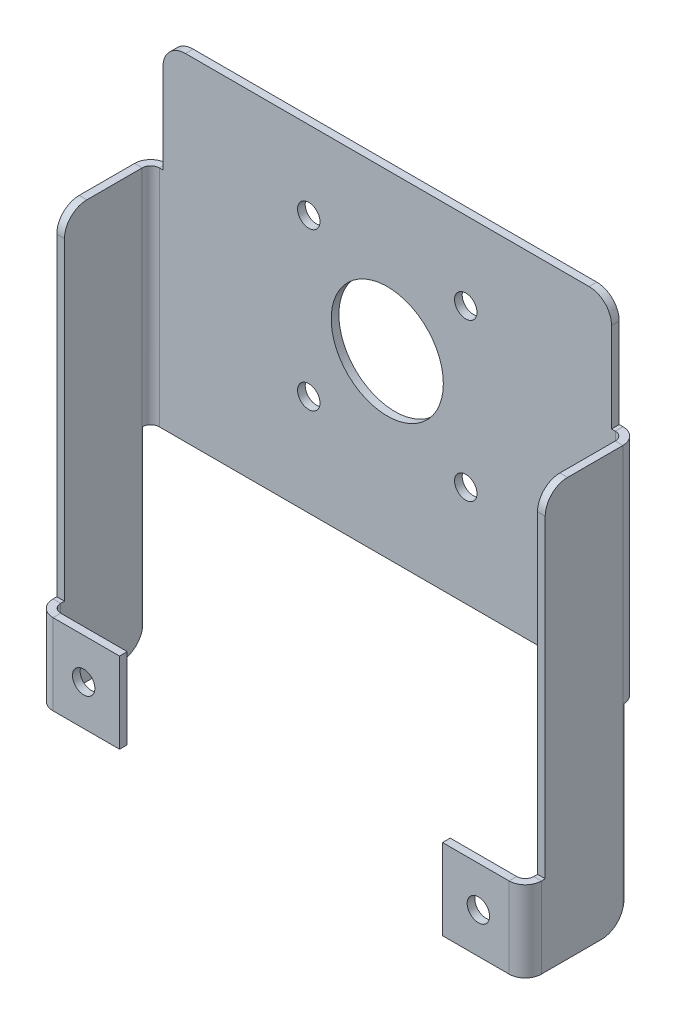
ISO-10303-21;
HEADER;
FILE_DESCRIPTION(('STEP AP214'),'2;1');
FILE_NAME('part.step','',(''),(''),'','','');
FILE_SCHEMA(('AUTOMOTIVE_DESIGN { 1 0 10303 214 1 1 1 1 }'));
ENDSEC;
DATA;
#1=APPLICATION_CONTEXT('core data for automotive mechanical design processes');
#2=APPLICATION_PROTOCOL_DEFINITION('international standard','automotive_design',2000,#1);
#3=PRODUCT_CONTEXT('',#1,'mechanical');
#4=PRODUCT('Part','Part','',(#3));
#5=PRODUCT_RELATED_PRODUCT_CATEGORY('part','',(#4));
#6=PRODUCT_DEFINITION_FORMATION('','',#4);
#7=PRODUCT_DEFINITION_CONTEXT('part definition',#1,'design');
#8=PRODUCT_DEFINITION('design','',#6,#7);
#9=PRODUCT_DEFINITION_SHAPE('','',#8);
#10=(LENGTH_UNIT() NAMED_UNIT(*) SI_UNIT(.MILLI.,.METRE.));
#11=(NAMED_UNIT(*) PLANE_ANGLE_UNIT() SI_UNIT($,.RADIAN.));
#12=(NAMED_UNIT(*) SI_UNIT($,.STERADIAN.) SOLID_ANGLE_UNIT());
#13=UNCERTAINTY_MEASURE_WITH_UNIT(LENGTH_MEASURE(1.E-05),#10,'distance_accuracy_value','');
#14=(GEOMETRIC_REPRESENTATION_CONTEXT(3) GLOBAL_UNCERTAINTY_ASSIGNED_CONTEXT((#13)) GLOBAL_UNIT_ASSIGNED_CONTEXT((#10,
#11,#12)) REPRESENTATION_CONTEXT('',''));
#15=CARTESIAN_POINT('',(0.,0.,0.));
#16=DIRECTION('',(0.,0.,1.));
#17=DIRECTION('',(1.,0.,0.));
#18=AXIS2_PLACEMENT_3D('',#15,#16,#17);
#19=CARTESIAN_POINT('',(-55.,0.,-1.70942));
#20=DIRECTION('',(0.,-1.,0.));
#21=DIRECTION('',(0.,0.,-1.));
#22=AXIS2_PLACEMENT_3D('',#19,#20,#21);
#23=PLANE('',#22);
#24=DIRECTION('',(1.,0.,0.));
#25=VECTOR('',#24,1.);
#26=CARTESIAN_POINT('',(-55.,0.,-1.70942));
#27=LINE('',#26,#25);
#28=CARTESIAN_POINT('',(-50.8325288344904,0.,-1.70942));
#29=VERTEX_POINT('',#28);
#30=CARTESIAN_POINT('',(50.8325288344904,0.,-1.70942));
#31=VERTEX_POINT('',#30);
#32=EDGE_CURVE('E624',#29,#31,#27,.T.);
#33=ORIENTED_EDGE('',*,*,#32,.T.);
#34=DIRECTION('',(0.,0.,1.));
#35=VECTOR('',#34,1.);
#36=CARTESIAN_POINT('',(50.8325288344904,0.,-1.70942));
#37=LINE('',#36,#35);
#38=CARTESIAN_POINT('',(50.8325288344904,0.,0.));
#39=VERTEX_POINT('',#38);
#40=EDGE_CURVE('E620',#31,#39,#37,.T.);
#41=ORIENTED_EDGE('',*,*,#40,.T.);
#42=DIRECTION('',(1.,0.,0.));
#43=VECTOR('',#42,1.);
#44=CARTESIAN_POINT('',(-55.,0.,0.));
#45=LINE('',#44,#43);
#46=CARTESIAN_POINT('',(-50.8325288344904,0.,0.));
#47=VERTEX_POINT('',#46);
#48=EDGE_CURVE('E629',#47,#39,#45,.T.);
#49=ORIENTED_EDGE('',*,*,#48,.F.);
#50=DIRECTION('',(0.,0.,1.));
#51=VECTOR('',#50,1.);
#52=CARTESIAN_POINT('',(-50.8325288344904,0.,-1.70942));
#53=LINE('',#52,#51);
#54=EDGE_CURVE('E1364',#29,#47,#53,.T.);
#55=ORIENTED_EDGE('',*,*,#54,.F.);
#56=EDGE_LOOP('',(#33,#41,#49,#55));
#57=FACE_BOUND('',#56,.T.);
#58=ADVANCED_FACE('F66',(#57),#23,.T.);
#59=CARTESIAN_POINT('',(50.,50.,-1.70942));
#60=DIRECTION('',(0.,1.,0.));
#61=DIRECTION('',(0.,0.,1.));
#62=AXIS2_PLACEMENT_3D('',#59,#60,#61);
#63=PLANE('',#62);
#64=DIRECTION('',(-1.,0.,0.));
#65=VECTOR('',#64,1.);
#66=CARTESIAN_POINT('',(50.,50.,0.));
#67=LINE('',#66,#65);
#68=CARTESIAN_POINT('',(50.8325288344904,50.,0.));
#69=VERTEX_POINT('',#68);
#70=CARTESIAN_POINT('',(50.,50.,0.));
#71=VERTEX_POINT('',#70);
#72=EDGE_CURVE('E634',#69,#71,#67,.T.);
#73=ORIENTED_EDGE('',*,*,#72,.F.);
#74=DIRECTION('',(0.,0.,-1.));
#75=VECTOR('',#74,1.);
#76=CARTESIAN_POINT('',(50.8325288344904,50.,-1.70942));
#77=LINE('',#76,#75);
#78=CARTESIAN_POINT('',(50.8325288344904,50.,-1.70942));
#79=VERTEX_POINT('',#78);
#80=EDGE_CURVE('E613',#69,#79,#77,.T.);
#81=ORIENTED_EDGE('',*,*,#80,.T.);
#82=DIRECTION('',(-1.,0.,0.));
#83=VECTOR('',#82,1.);
#84=CARTESIAN_POINT('',(50.,50.,-1.70942));
#85=LINE('',#84,#83);
#86=CARTESIAN_POINT('',(50.,50.,-1.70942));
#87=VERTEX_POINT('',#86);
#88=EDGE_CURVE('E632',#79,#87,#85,.T.);
#89=ORIENTED_EDGE('',*,*,#88,.T.);
#90=DIRECTION('',(0.,0.,1.));
#91=VECTOR('',#90,1.);
#92=CARTESIAN_POINT('',(50.,50.,-1.70942));
#93=LINE('',#92,#91);
#94=EDGE_CURVE('E627',#87,#71,#93,.T.);
#95=ORIENTED_EDGE('',*,*,#94,.T.);
#96=EDGE_LOOP('',(#73,#81,#89,#95));
#97=FACE_BOUND('',#96,.T.);
#98=ADVANCED_FACE('F729',(#97),#63,.T.);
#99=CARTESIAN_POINT('',(-60.,-38.,0.));
#100=DIRECTION('',(0.,0.,1.));
#101=DIRECTION('',(1.,0.,0.));
#102=AXIS2_PLACEMENT_3D('',#99,#100,#101);
#103=PLANE('',#102);
#104=CARTESIAN_POINT('',(0.,40.,0.));
#105=DIRECTION('',(0.,0.,1.));
#106=DIRECTION('',(1.,0.,0.));
#107=AXIS2_PLACEMENT_3D('',#104,#105,#106);
#108=CIRCLE('',#107,12.5);
#109=CARTESIAN_POINT('',(12.5,40.,0.));
#110=VERTEX_POINT('',#109);
#111=EDGE_CURVE('E1488',#110,#110,#108,.T.);
#112=ORIENTED_EDGE('',*,*,#111,.F.);
#113=EDGE_LOOP('',(#112));
#114=FACE_BOUND('',#113,.T.);
#115=CARTESIAN_POINT('',(17.5,57.5,0.));
#116=DIRECTION('',(0.,0.,1.));
#117=DIRECTION('',(1.,0.,0.));
#118=AXIS2_PLACEMENT_3D('',#115,#116,#117);
#119=CIRCLE('',#118,2.49999999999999);
#120=CARTESIAN_POINT('',(20.,57.5,0.));
#121=VERTEX_POINT('',#120);
#122=EDGE_CURVE('E1482',#121,#121,#119,.T.);
#123=ORIENTED_EDGE('',*,*,#122,.F.);
#124=EDGE_LOOP('',(#123));
#125=FACE_BOUND('',#124,.T.);
#126=CARTESIAN_POINT('',(-17.5,22.5,0.));
#127=DIRECTION('',(0.,0.,1.));
#128=DIRECTION('',(1.,0.,0.));
#129=AXIS2_PLACEMENT_3D('',#126,#127,#128);
#130=CIRCLE('',#129,2.49999999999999);
#131=CARTESIAN_POINT('',(-15.,22.5,0.));
#132=VERTEX_POINT('',#131);
#133=EDGE_CURVE('E1476',#132,#132,#130,.T.);
#134=ORIENTED_EDGE('',*,*,#133,.F.);
#135=EDGE_LOOP('',(#134));
#136=FACE_BOUND('',#135,.T.);
#137=CARTESIAN_POINT('',(-17.5,57.5,0.));
#138=DIRECTION('',(0.,0.,1.));
#139=DIRECTION('',(1.,0.,0.));
#140=AXIS2_PLACEMENT_3D('',#137,#138,#139);
#141=CIRCLE('',#140,2.49999999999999);
#142=CARTESIAN_POINT('',(-15.,57.5,0.));
#143=VERTEX_POINT('',#142);
#144=EDGE_CURVE('E1470',#143,#143,#141,.T.);
#145=ORIENTED_EDGE('',*,*,#144,.F.);
#146=EDGE_LOOP('',(#145));
#147=FACE_BOUND('',#146,.T.);
#148=CARTESIAN_POINT('',(17.5,22.5,0.));
#149=DIRECTION('',(0.,0.,1.));
#150=DIRECTION('',(1.,0.,0.));
#151=AXIS2_PLACEMENT_3D('',#148,#149,#150);
#152=CIRCLE('',#151,2.49999999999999);
#153=CARTESIAN_POINT('',(20.,22.5,0.));
#154=VERTEX_POINT('',#153);
#155=EDGE_CURVE('E1464',#154,#154,#152,.T.);
#156=ORIENTED_EDGE('',*,*,#155,.F.);
#157=EDGE_LOOP('',(#156));
#158=FACE_BOUND('',#157,.T.);
#159=ORIENTED_EDGE('',*,*,#48,.T.);
#160=DIRECTION('',(0.,1.,0.));
#161=VECTOR('',#160,1.);
#162=CARTESIAN_POINT('',(50.8325288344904,-38.,0.));
#163=LINE('',#162,#161);
#164=EDGE_CURVE('E617',#39,#69,#163,.T.);
#165=ORIENTED_EDGE('',*,*,#164,.T.);
#166=ORIENTED_EDGE('',*,*,#72,.T.);
#167=DIRECTION('',(0.,1.,0.));
#168=VECTOR('',#167,1.);
#169=CARTESIAN_POINT('',(50.,70.,0.));
#170=LINE('',#169,#168);
#171=CARTESIAN_POINT('',(50.,70.,0.));
#172=VERTEX_POINT('',#171);
#173=EDGE_CURVE('E636',#71,#172,#170,.T.);
#174=ORIENTED_EDGE('',*,*,#173,.T.);
#175=CARTESIAN_POINT('',(45.,70.,0.));
#176=DIRECTION('',(0.,0.,1.));
#177=DIRECTION('',(1.,0.,0.));
#178=AXIS2_PLACEMENT_3D('',#175,#176,#177);
#179=CIRCLE('',#178,5.);
#180=CARTESIAN_POINT('',(45.,75.,0.));
#181=VERTEX_POINT('',#180);
#182=EDGE_CURVE('E1509',#172,#181,#179,.T.);
#183=ORIENTED_EDGE('',*,*,#182,.T.);
#184=DIRECTION('',(-1.,0.,0.));
#185=VECTOR('',#184,1.);
#186=CARTESIAN_POINT('',(45.,75.,0.));
#187=LINE('',#186,#185);
#188=CARTESIAN_POINT('',(-45.,75.,0.));
#189=VERTEX_POINT('',#188);
#190=EDGE_CURVE('E1512',#181,#189,#187,.T.);
#191=ORIENTED_EDGE('',*,*,#190,.T.);
#192=CARTESIAN_POINT('',(-45.,70.,0.));
#193=DIRECTION('',(0.,0.,1.));
#194=DIRECTION('',(1.,0.,0.));
#195=AXIS2_PLACEMENT_3D('',#192,#193,#194);
#196=CIRCLE('',#195,5.);
#197=CARTESIAN_POINT('',(-50.,70.,0.));
#198=VERTEX_POINT('',#197);
#199=EDGE_CURVE('E1515',#189,#198,#196,.T.);
#200=ORIENTED_EDGE('',*,*,#199,.T.);
#201=DIRECTION('',(0.,-1.,0.));
#202=VECTOR('',#201,1.);
#203=CARTESIAN_POINT('',(-50.,70.,0.));
#204=LINE('',#203,#202);
#205=CARTESIAN_POINT('',(-50.,50.,0.));
#206=VERTEX_POINT('',#205);
#207=EDGE_CURVE('E1518',#198,#206,#204,.T.);
#208=ORIENTED_EDGE('',*,*,#207,.T.);
#209=DIRECTION('',(-1.,0.,0.));
#210=VECTOR('',#209,1.);
#211=CARTESIAN_POINT('',(-50.,50.,0.));
#212=LINE('',#211,#210);
#213=CARTESIAN_POINT('',(-50.8325288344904,50.,0.));
#214=VERTEX_POINT('',#213);
#215=EDGE_CURVE('E633',#206,#214,#212,.T.);
#216=ORIENTED_EDGE('',*,*,#215,.T.);
#217=DIRECTION('',(0.,1.,0.));
#218=VECTOR('',#217,1.);
#219=CARTESIAN_POINT('',(-50.8325288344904,-38.,0.));
#220=LINE('',#219,#218);
#221=EDGE_CURVE('E1352',#47,#214,#220,.T.);
#222=ORIENTED_EDGE('',*,*,#221,.F.);
#223=EDGE_LOOP('',(#159,#165,#166,#174,#183,#191,#200,#208,#216,#222));
#224=FACE_BOUND('',#223,.T.);
#225=ADVANCED_FACE('F735',(#114,#125,#136,#147,#158,#224),#103,.T.);
#226=CARTESIAN_POINT('',(-60.,-38.,-1.70942));
#227=DIRECTION('',(0.,0.,1.));
#228=DIRECTION('',(1.,0.,0.));
#229=AXIS2_PLACEMENT_3D('',#226,#227,#228);
#230=PLANE('',#229);
#231=DIRECTION('',(0.,1.,0.));
#232=VECTOR('',#231,1.);
#233=CARTESIAN_POINT('',(50.8325288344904,-38.,-1.70942));
#234=LINE('',#233,#232);
#235=EDGE_CURVE('E611',#31,#79,#234,.T.);
#236=ORIENTED_EDGE('',*,*,#235,.F.);
#237=ORIENTED_EDGE('',*,*,#32,.F.);
#238=DIRECTION('',(0.,1.,0.));
#239=VECTOR('',#238,1.);
#240=CARTESIAN_POINT('',(-50.8325288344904,-38.,-1.70942));
#241=LINE('',#240,#239);
#242=CARTESIAN_POINT('',(-50.8325288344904,50.,-1.70942));
#243=VERTEX_POINT('',#242);
#244=EDGE_CURVE('E1522',#29,#243,#241,.T.);
#245=ORIENTED_EDGE('',*,*,#244,.T.);
#246=DIRECTION('',(-1.,0.,0.));
#247=VECTOR('',#246,1.);
#248=CARTESIAN_POINT('',(-50.,50.,-1.70942));
#249=LINE('',#248,#247);
#250=CARTESIAN_POINT('',(-50.,50.,-1.70942));
#251=VERTEX_POINT('',#250);
#252=EDGE_CURVE('E628',#251,#243,#249,.T.);
#253=ORIENTED_EDGE('',*,*,#252,.F.);
#254=DIRECTION('',(0.,-1.,0.));
#255=VECTOR('',#254,1.);
#256=CARTESIAN_POINT('',(-50.,70.,-1.70942));
#257=LINE('',#256,#255);
#258=CARTESIAN_POINT('',(-50.,70.,-1.70942));
#259=VERTEX_POINT('',#258);
#260=EDGE_CURVE('E1504',#259,#251,#257,.T.);
#261=ORIENTED_EDGE('',*,*,#260,.F.);
#262=CARTESIAN_POINT('',(-45.,70.,-1.70942));
#263=DIRECTION('',(0.,0.,1.));
#264=DIRECTION('',(1.,0.,0.));
#265=AXIS2_PLACEMENT_3D('',#262,#263,#264);
#266=CIRCLE('',#265,5.);
#267=CARTESIAN_POINT('',(-45.,75.,-1.70942));
#268=VERTEX_POINT('',#267);
#269=EDGE_CURVE('E1501',#268,#259,#266,.T.);
#270=ORIENTED_EDGE('',*,*,#269,.F.);
#271=DIRECTION('',(-1.,0.,0.));
#272=VECTOR('',#271,1.);
#273=CARTESIAN_POINT('',(45.,75.,-1.70942));
#274=LINE('',#273,#272);
#275=CARTESIAN_POINT('',(45.,75.,-1.70942));
#276=VERTEX_POINT('',#275);
#277=EDGE_CURVE('E1498',#276,#268,#274,.T.);
#278=ORIENTED_EDGE('',*,*,#277,.F.);
#279=CARTESIAN_POINT('',(45.,70.,-1.70942));
#280=DIRECTION('',(0.,0.,1.));
#281=DIRECTION('',(1.,0.,0.));
#282=AXIS2_PLACEMENT_3D('',#279,#280,#281);
#283=CIRCLE('',#282,5.);
#284=CARTESIAN_POINT('',(50.,70.,-1.70942));
#285=VERTEX_POINT('',#284);
#286=EDGE_CURVE('E1495',#285,#276,#283,.T.);
#287=ORIENTED_EDGE('',*,*,#286,.F.);
#288=DIRECTION('',(0.,1.,0.));
#289=VECTOR('',#288,1.);
#290=CARTESIAN_POINT('',(50.,70.,-1.70942));
#291=LINE('',#290,#289);
#292=EDGE_CURVE('E639',#87,#285,#291,.T.);
#293=ORIENTED_EDGE('',*,*,#292,.F.);
#294=ORIENTED_EDGE('',*,*,#88,.F.);
#295=EDGE_LOOP('',(#236,#237,#245,#253,#261,#270,#278,#287,#293,#294));
#296=FACE_BOUND('',#295,.T.);
#297=CARTESIAN_POINT('',(0.,40.,-1.70942));
#298=DIRECTION('',(0.,0.,1.));
#299=DIRECTION('',(1.,0.,0.));
#300=AXIS2_PLACEMENT_3D('',#297,#298,#299);
#301=CIRCLE('',#300,12.5);
#302=CARTESIAN_POINT('',(12.5,40.,-1.70942));
#303=VERTEX_POINT('',#302);
#304=EDGE_CURVE('E637',#303,#303,#301,.T.);
#305=ORIENTED_EDGE('',*,*,#304,.T.);
#306=EDGE_LOOP('',(#305));
#307=FACE_BOUND('',#306,.T.);
#308=CARTESIAN_POINT('',(17.5,57.5,-1.70942));
#309=DIRECTION('',(0.,0.,1.));
#310=DIRECTION('',(1.,0.,0.));
#311=AXIS2_PLACEMENT_3D('',#308,#309,#310);
#312=CIRCLE('',#311,2.49999999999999);
#313=CARTESIAN_POINT('',(20.,57.5,-1.70942));
#314=VERTEX_POINT('',#313);
#315=EDGE_CURVE('E1485',#314,#314,#312,.T.);
#316=ORIENTED_EDGE('',*,*,#315,.T.);
#317=EDGE_LOOP('',(#316));
#318=FACE_BOUND('',#317,.T.);
#319=CARTESIAN_POINT('',(-17.5,22.5,-1.70942));
#320=DIRECTION('',(0.,0.,1.));
#321=DIRECTION('',(1.,0.,0.));
#322=AXIS2_PLACEMENT_3D('',#319,#320,#321);
#323=CIRCLE('',#322,2.49999999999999);
#324=CARTESIAN_POINT('',(-15.,22.5,-1.70942));
#325=VERTEX_POINT('',#324);
#326=EDGE_CURVE('E1479',#325,#325,#323,.T.);
#327=ORIENTED_EDGE('',*,*,#326,.T.);
#328=EDGE_LOOP('',(#327));
#329=FACE_BOUND('',#328,.T.);
#330=CARTESIAN_POINT('',(-17.5,57.5,-1.70942));
#331=DIRECTION('',(0.,0.,1.));
#332=DIRECTION('',(1.,0.,0.));
#333=AXIS2_PLACEMENT_3D('',#330,#331,#332);
#334=CIRCLE('',#333,2.49999999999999);
#335=CARTESIAN_POINT('',(-15.,57.5,-1.70942));
#336=VERTEX_POINT('',#335);
#337=EDGE_CURVE('E1473',#336,#336,#334,.T.);
#338=ORIENTED_EDGE('',*,*,#337,.T.);
#339=EDGE_LOOP('',(#338));
#340=FACE_BOUND('',#339,.T.);
#341=CARTESIAN_POINT('',(17.5,22.5,-1.70942));
#342=DIRECTION('',(0.,0.,1.));
#343=DIRECTION('',(1.,0.,0.));
#344=AXIS2_PLACEMENT_3D('',#341,#342,#343);
#345=CIRCLE('',#344,2.49999999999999);
#346=CARTESIAN_POINT('',(20.,22.5,-1.70942));
#347=VERTEX_POINT('',#346);
#348=EDGE_CURVE('E1467',#347,#347,#345,.T.);
#349=ORIENTED_EDGE('',*,*,#348,.T.);
#350=EDGE_LOOP('',(#349));
#351=FACE_BOUND('',#350,.T.);
#352=ADVANCED_FACE('F744',(#296,#307,#318,#329,#340,#351),#230,.F.);
#353=CARTESIAN_POINT('',(-50.,50.,-1.70942));
#354=DIRECTION('',(0.,1.,0.));
#355=DIRECTION('',(0.,0.,1.));
#356=AXIS2_PLACEMENT_3D('',#353,#354,#355);
#357=PLANE('',#356);
#358=DIRECTION('',(0.,0.,-1.));
#359=VECTOR('',#358,1.);
#360=CARTESIAN_POINT('',(-50.8325288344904,50.,-1.70942));
#361=LINE('',#360,#359);
#362=EDGE_CURVE('E614',#214,#243,#361,.T.);
#363=ORIENTED_EDGE('',*,*,#362,.F.);
#364=ORIENTED_EDGE('',*,*,#215,.F.);
#365=DIRECTION('',(0.,0.,1.));
#366=VECTOR('',#365,1.);
#367=CARTESIAN_POINT('',(-50.,50.,-1.70942));
#368=LINE('',#367,#366);
#369=EDGE_CURVE('E1520',#251,#206,#368,.T.);
#370=ORIENTED_EDGE('',*,*,#369,.F.);
#371=ORIENTED_EDGE('',*,*,#252,.T.);
#372=EDGE_LOOP('',(#363,#364,#370,#371));
#373=FACE_BOUND('',#372,.T.);
#374=ADVANCED_FACE('F740',(#373),#357,.T.);
#375=CARTESIAN_POINT('',(-50.,70.,-1.70942));
#376=DIRECTION('',(-1.,0.,0.));
#377=DIRECTION('',(0.,0.,1.));
#378=AXIS2_PLACEMENT_3D('',#375,#376,#377);
#379=PLANE('',#378);
#380=ORIENTED_EDGE('',*,*,#207,.F.);
#381=DIRECTION('',(0.,0.,1.));
#382=VECTOR('',#381,1.);
#383=CARTESIAN_POINT('',(-50.,70.,-1.70942));
#384=LINE('',#383,#382);
#385=EDGE_CURVE('E1523',#259,#198,#384,.T.);
#386=ORIENTED_EDGE('',*,*,#385,.F.);
#387=ORIENTED_EDGE('',*,*,#260,.T.);
#388=ORIENTED_EDGE('',*,*,#369,.T.);
#389=EDGE_LOOP('',(#380,#386,#387,#388));
#390=FACE_BOUND('',#389,.T.);
#391=ADVANCED_FACE('F1270',(#390),#379,.T.);
#392=CARTESIAN_POINT('',(-45.,70.,-1.70942));
#393=DIRECTION('',(0.,0.,1.));
#394=DIRECTION('',(1.,0.,0.));
#395=AXIS2_PLACEMENT_3D('',#392,#393,#394);
#396=CYLINDRICAL_SURFACE('',#395,5.);
#397=ORIENTED_EDGE('',*,*,#199,.F.);
#398=DIRECTION('',(0.,0.,1.));
#399=VECTOR('',#398,1.);
#400=CARTESIAN_POINT('',(-45.,75.,-1.70942));
#401=LINE('',#400,#399);
#402=EDGE_CURVE('E1525',#268,#189,#401,.T.);
#403=ORIENTED_EDGE('',*,*,#402,.F.);
#404=ORIENTED_EDGE('',*,*,#269,.T.);
#405=ORIENTED_EDGE('',*,*,#385,.T.);
#406=EDGE_LOOP('',(#397,#403,#404,#405));
#407=FACE_BOUND('',#406,.T.);
#408=ADVANCED_FACE('F1259',(#407),#396,.T.);
#409=CARTESIAN_POINT('',(45.,75.,-1.70942));
#410=DIRECTION('',(0.,1.,0.));
#411=DIRECTION('',(0.,0.,1.));
#412=AXIS2_PLACEMENT_3D('',#409,#410,#411);
#413=PLANE('',#412);
#414=ORIENTED_EDGE('',*,*,#190,.F.);
#415=DIRECTION('',(0.,0.,1.));
#416=VECTOR('',#415,1.);
#417=CARTESIAN_POINT('',(45.,75.,-1.70942));
#418=LINE('',#417,#416);
#419=EDGE_CURVE('E1527',#276,#181,#418,.T.);
#420=ORIENTED_EDGE('',*,*,#419,.F.);
#421=ORIENTED_EDGE('',*,*,#277,.T.);
#422=ORIENTED_EDGE('',*,*,#402,.T.);
#423=EDGE_LOOP('',(#414,#420,#421,#422));
#424=FACE_BOUND('',#423,.T.);
#425=ADVANCED_FACE('F1248',(#424),#413,.T.);
#426=CARTESIAN_POINT('',(45.,70.,-1.70942));
#427=DIRECTION('',(0.,0.,1.));
#428=DIRECTION('',(1.,0.,0.));
#429=AXIS2_PLACEMENT_3D('',#426,#427,#428);
#430=CYLINDRICAL_SURFACE('',#429,5.);
#431=ORIENTED_EDGE('',*,*,#182,.F.);
#432=DIRECTION('',(0.,0.,1.));
#433=VECTOR('',#432,1.);
#434=CARTESIAN_POINT('',(50.,70.,-1.70942));
#435=LINE('',#434,#433);
#436=EDGE_CURVE('E1529',#285,#172,#435,.T.);
#437=ORIENTED_EDGE('',*,*,#436,.F.);
#438=ORIENTED_EDGE('',*,*,#286,.T.);
#439=ORIENTED_EDGE('',*,*,#419,.T.);
#440=EDGE_LOOP('',(#431,#437,#438,#439));
#441=FACE_BOUND('',#440,.T.);
#442=ADVANCED_FACE('F1238',(#441),#430,.T.);
#443=CARTESIAN_POINT('',(50.,70.,-1.70942));
#444=DIRECTION('',(1.,0.,0.));
#445=DIRECTION('',(0.,0.,-1.));
#446=AXIS2_PLACEMENT_3D('',#443,#444,#445);
#447=PLANE('',#446);
#448=ORIENTED_EDGE('',*,*,#173,.F.);
#449=ORIENTED_EDGE('',*,*,#94,.F.);
#450=ORIENTED_EDGE('',*,*,#292,.T.);
#451=ORIENTED_EDGE('',*,*,#436,.T.);
#452=EDGE_LOOP('',(#448,#449,#450,#451));
#453=FACE_BOUND('',#452,.T.);
#454=ADVANCED_FACE('F1227',(#453),#447,.T.);
#455=CARTESIAN_POINT('',(0.,40.,-1.70942));
#456=DIRECTION('',(0.,0.,1.));
#457=DIRECTION('',(1.,0.,0.));
#458=AXIS2_PLACEMENT_3D('',#455,#456,#457);
#459=CYLINDRICAL_SURFACE('',#458,12.5);
#460=CARTESIAN_POINT('',(12.5,40.,-1.70942));
#461=CARTESIAN_POINT('',(12.5,40.,-1.69161354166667));
#462=CARTESIAN_POINT('',(12.5,40.,-1.67380708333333));
#463=CARTESIAN_POINT('',(12.5,40.,-1.63819416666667));
#464=CARTESIAN_POINT('',(12.5,40.,-1.62038770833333));
#465=CARTESIAN_POINT('',(12.5,40.,-1.58477479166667));
#466=CARTESIAN_POINT('',(12.5,40.,-1.56696833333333));
#467=CARTESIAN_POINT('',(12.5,40.,-1.53135541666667));
#468=CARTESIAN_POINT('',(12.5,40.,-1.51354895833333));
#469=CARTESIAN_POINT('',(12.5,40.,-1.47793604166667));
#470=CARTESIAN_POINT('',(12.5,40.,-1.46012958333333));
#471=CARTESIAN_POINT('',(12.5,40.,-1.42451666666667));
#472=CARTESIAN_POINT('',(12.5,40.,-1.40671020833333));
#473=CARTESIAN_POINT('',(12.5,40.,-1.37109729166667));
#474=CARTESIAN_POINT('',(12.5,40.,-1.35329083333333));
#475=CARTESIAN_POINT('',(12.5,40.,-1.31767791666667));
#476=CARTESIAN_POINT('',(12.5,40.,-1.29987145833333));
#477=CARTESIAN_POINT('',(12.5,40.,-1.26425854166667));
#478=CARTESIAN_POINT('',(12.5,40.,-1.24645208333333));
#479=CARTESIAN_POINT('',(12.5,40.,-1.21083916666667));
#480=CARTESIAN_POINT('',(12.5,40.,-1.19303270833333));
#481=CARTESIAN_POINT('',(12.5,40.,-1.15741979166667));
#482=CARTESIAN_POINT('',(12.5,40.,-1.13961333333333));
#483=CARTESIAN_POINT('',(12.5,40.,-1.10400041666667));
#484=CARTESIAN_POINT('',(12.5,40.,-1.08619395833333));
#485=CARTESIAN_POINT('',(12.5,40.,-1.05058104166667));
#486=CARTESIAN_POINT('',(12.5,40.,-1.03277458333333));
#487=CARTESIAN_POINT('',(12.5,40.,-0.997161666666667));
#488=CARTESIAN_POINT('',(12.5,40.,-0.979355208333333));
#489=CARTESIAN_POINT('',(12.5,40.,-0.943742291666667));
#490=CARTESIAN_POINT('',(12.5,40.,-0.925935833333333));
#491=CARTESIAN_POINT('',(12.5,40.,-0.890322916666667));
#492=CARTESIAN_POINT('',(12.5,40.,-0.872516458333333));
#493=CARTESIAN_POINT('',(12.5,40.,-0.836903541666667));
#494=CARTESIAN_POINT('',(12.5,40.,-0.819097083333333));
#495=CARTESIAN_POINT('',(12.5,40.,-0.783484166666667));
#496=CARTESIAN_POINT('',(12.5,40.,-0.765677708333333));
#497=CARTESIAN_POINT('',(12.5,40.,-0.730064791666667));
#498=CARTESIAN_POINT('',(12.5,40.,-0.712258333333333));
#499=CARTESIAN_POINT('',(12.5,40.,-0.676645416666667));
#500=CARTESIAN_POINT('',(12.5,40.,-0.658838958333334));
#501=CARTESIAN_POINT('',(12.5,40.,-0.623226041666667));
#502=CARTESIAN_POINT('',(12.5,40.,-0.605419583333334));
#503=CARTESIAN_POINT('',(12.5,40.,-0.569806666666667));
#504=CARTESIAN_POINT('',(12.5,40.,-0.552000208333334));
#505=CARTESIAN_POINT('',(12.5,40.,-0.516387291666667));
#506=CARTESIAN_POINT('',(12.5,40.,-0.498580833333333));
#507=CARTESIAN_POINT('',(12.5,40.,-0.462967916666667));
#508=CARTESIAN_POINT('',(12.5,40.,-0.445161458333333));
#509=CARTESIAN_POINT('',(12.5,40.,-0.409548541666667));
#510=CARTESIAN_POINT('',(12.5,40.,-0.391742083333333));
#511=CARTESIAN_POINT('',(12.5,40.,-0.356129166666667));
#512=CARTESIAN_POINT('',(12.5,40.,-0.338322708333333));
#513=CARTESIAN_POINT('',(12.5,40.,-0.302709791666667));
#514=CARTESIAN_POINT('',(12.5,40.,-0.284903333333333));
#515=CARTESIAN_POINT('',(12.5,40.,-0.249290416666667));
#516=CARTESIAN_POINT('',(12.5,40.,-0.231483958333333));
#517=CARTESIAN_POINT('',(12.5,40.,-0.195871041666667));
#518=CARTESIAN_POINT('',(12.5,40.,-0.178064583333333));
#519=CARTESIAN_POINT('',(12.5,40.,-0.142451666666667));
#520=CARTESIAN_POINT('',(12.5,40.,-0.124645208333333));
#521=CARTESIAN_POINT('',(12.5,40.,-0.0890322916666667));
#522=CARTESIAN_POINT('',(12.5,40.,-0.0712258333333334));
#523=CARTESIAN_POINT('',(12.5,40.,-0.0356129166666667));
#524=CARTESIAN_POINT('',(12.5,40.,-0.0178064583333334));
#525=CARTESIAN_POINT('',(12.5,40.,0.));
#526=B_SPLINE_CURVE_WITH_KNOTS('',3,(#460,#461,#462,#463,#464,#465,#466,#467,#468,#469,#470,
#471,#472,#473,#474,#475,#476,#477,#478,#479,#480,#481,#482,#483,#484,#485,#486,#487,#488,#489,
#490,#491,#492,#493,#494,#495,#496,#497,#498,#499,#500,#501,#502,#503,#504,#505,#506,#507,#508,
#509,#510,#511,#512,#513,#514,#515,#516,#517,#518,#519,#520,#521,#522,#523,#524,#525),
.UNSPECIFIED.,.F.,.F.,(4,2,2,2,2,2,2,2,2,2,2,2,2,2,2,2,2,2,2,2,2,2,2,2,2,2,2,2,2,2,2,2,4),(0.,
0.0534193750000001,0.10683875,0.160258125,0.2136775,0.267096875,0.32051625,0.373935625,0.427355,
0.480774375,0.53419375,0.587613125,0.6410325,0.694451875,0.74787125,0.801290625,0.85471,
0.908129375,0.96154875,1.014968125,1.0683875,1.121806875,1.17522625,1.228645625,1.282065,
1.335484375,1.38890375,1.442323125,1.4957425,1.549161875,1.60258125,1.656000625,1.70942),.UNSPECIFIED.);
#527=EDGE_CURVE('BSEAM1218',#303,#110,#526,.T.);
#528=ORIENTED_EDGE('',*,*,#304,.F.);
#529=ORIENTED_EDGE('',*,*,#111,.T.);
#530=ORIENTED_EDGE('',*,*,#527,.T.);
#531=ORIENTED_EDGE('',*,*,#527,.F.);
#532=EDGE_LOOP('',(#528,#530,#529,#531));
#533=FACE_BOUND('',#532,.T.);
#534=ADVANCED_FACE('F1218',(#533),#459,.F.);
#535=CARTESIAN_POINT('',(17.5,57.5,0.));
#536=DIRECTION('',(0.,0.,1.));
#537=DIRECTION('',(1.,0.,0.));
#538=AXIS2_PLACEMENT_3D('',#535,#536,#537);
#539=CYLINDRICAL_SURFACE('',#538,2.49999999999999);
#540=ORIENTED_EDGE('',*,*,#315,.F.);
#541=EDGE_LOOP('',(#540));
#542=FACE_BOUND('',#541,.T.);
#543=ORIENTED_EDGE('',*,*,#122,.T.);
#544=EDGE_LOOP('',(#543));
#545=FACE_BOUND('',#544,.T.);
#546=ADVANCED_FACE('F1209',(#542,#545),#539,.F.);
#547=CARTESIAN_POINT('',(-17.5,22.5,0.));
#548=DIRECTION('',(0.,0.,1.));
#549=DIRECTION('',(1.,0.,0.));
#550=AXIS2_PLACEMENT_3D('',#547,#548,#549);
#551=CYLINDRICAL_SURFACE('',#550,2.49999999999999);
#552=ORIENTED_EDGE('',*,*,#326,.F.);
#553=EDGE_LOOP('',(#552));
#554=FACE_BOUND('',#553,.T.);
#555=ORIENTED_EDGE('',*,*,#133,.T.);
#556=EDGE_LOOP('',(#555));
#557=FACE_BOUND('',#556,.T.);
#558=ADVANCED_FACE('F1200',(#554,#557),#551,.F.);
#559=CARTESIAN_POINT('',(-17.5,57.5,0.));
#560=DIRECTION('',(0.,0.,1.));
#561=DIRECTION('',(1.,0.,0.));
#562=AXIS2_PLACEMENT_3D('',#559,#560,#561);
#563=CYLINDRICAL_SURFACE('',#562,2.49999999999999);
#564=ORIENTED_EDGE('',*,*,#337,.F.);
#565=EDGE_LOOP('',(#564));
#566=FACE_BOUND('',#565,.T.);
#567=ORIENTED_EDGE('',*,*,#144,.T.);
#568=EDGE_LOOP('',(#567));
#569=FACE_BOUND('',#568,.T.);
#570=ADVANCED_FACE('F1191',(#566,#569),#563,.F.);
#571=CARTESIAN_POINT('',(17.5,22.5,0.));
#572=DIRECTION('',(0.,0.,1.));
#573=DIRECTION('',(1.,0.,0.));
#574=AXIS2_PLACEMENT_3D('',#571,#572,#573);
#575=CYLINDRICAL_SURFACE('',#574,2.49999999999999);
#576=ORIENTED_EDGE('',*,*,#348,.F.);
#577=EDGE_LOOP('',(#576));
#578=FACE_BOUND('',#577,.T.);
#579=ORIENTED_EDGE('',*,*,#155,.T.);
#580=EDGE_LOOP('',(#579));
#581=FACE_BOUND('',#580,.T.);
#582=ADVANCED_FACE('F837',(#578,#581),#575,.F.);
#583=CARTESIAN_POINT('',(-54.4402956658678,-38.,1.68579592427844));
#584=CARTESIAN_POINT('',(-54.4414494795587,-38.4360550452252,1.70478594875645));
#585=CARTESIAN_POINT('',(-54.4469488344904,-38.8637796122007,1.77779571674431));
#586=CARTESIAN_POINT('',(-54.4469488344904,-39.2832244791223,1.905));
#587=CARTESIAN_POINT('',(-52.7340222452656,-38.,1.78946728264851));
#588=CARTESIAN_POINT('',(-52.7346303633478,-38.4360508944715,1.7994759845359));
#589=CARTESIAN_POINT('',(-52.7375288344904,-38.8637870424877,1.83795746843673));
#590=CARTESIAN_POINT('',(-52.7375288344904,-39.2832244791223,1.905));
#591=B_SPLINE_SURFACE_WITH_KNOTS('',1,3,((#583,#584,#585,#586),(#587,#588,#589,#590)),
.UNSPECIFIED.,.F.,.F.,.F.,(2,2),(4,4),(0.,1.),(0.,1.),.UNSPECIFIED.);
#592=CARTESIAN_POINT('',(-54.4402956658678,-38.,1.68579592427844));
#593=CARTESIAN_POINT('',(-52.7340222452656,-38.,1.78946728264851));
#594=B_SPLINE_CURVE_WITH_KNOTS('',1,(#592,#593),.UNSPECIFIED.,.F.,.F.,(2,2),(0.,1.),.UNSPECIFIED.);
#595=CARTESIAN_POINT('',(-52.7340222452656,-38.,1.78946728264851));
#596=VERTEX_POINT('',#595);
#597=CARTESIAN_POINT('',(-54.4402956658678,-38.,1.68579592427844));
#598=VERTEX_POINT('',#597);
#599=EDGE_CURVE('E1444',#596,#598,#594,.F.);
#600=CARTESIAN_POINT('',(-52.7340222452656,-38.,1.78946728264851));
#601=CARTESIAN_POINT('',(-52.7346303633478,-38.4360508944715,1.7994759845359));
#602=CARTESIAN_POINT('',(-52.7375288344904,-38.8637870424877,1.83795746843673));
#603=CARTESIAN_POINT('',(-52.7375288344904,-39.2832244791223,1.905));
#604=B_SPLINE_CURVE_WITH_KNOTS('',3,(#600,#601,#602,#603),.UNSPECIFIED.,.F.,.F.,(4,4),(0.,1.),.UNSPECIFIED.);
#605=CARTESIAN_POINT('',(-52.7375288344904,-39.2832244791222,1.90500000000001));
#606=VERTEX_POINT('',#605);
#607=EDGE_CURVE('E1368',#596,#606,#604,.T.);
#608=CARTESIAN_POINT('',(-52.7375288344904,-39.2832244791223,1.905));
#609=CARTESIAN_POINT('',(-54.4469488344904,-39.2832244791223,1.905));
#610=B_SPLINE_CURVE_WITH_KNOTS('',1,(#608,#609),.UNSPECIFIED.,.F.,.F.,(2,2),(0.,1.),.UNSPECIFIED.);
#611=CARTESIAN_POINT('',(-54.4469488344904,-39.2832244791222,1.90500000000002));
#612=VERTEX_POINT('',#611);
#613=EDGE_CURVE('E608',#612,#606,#610,.F.);
#614=CARTESIAN_POINT('',(-54.4469488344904,-39.2832244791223,1.905));
#615=CARTESIAN_POINT('',(-54.4469488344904,-38.8637796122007,1.77779571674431));
#616=CARTESIAN_POINT('',(-54.4414494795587,-38.4360550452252,1.70478594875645));
#617=CARTESIAN_POINT('',(-54.4402956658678,-38.,1.68579592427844));
#618=B_SPLINE_CURVE_WITH_KNOTS('',3,(#614,#615,#616,#617),.UNSPECIFIED.,.F.,.F.,(4,4),(0.,1.),.UNSPECIFIED.);
#619=EDGE_CURVE('E1401',#598,#612,#618,.F.);
#620=ORIENTED_EDGE('',*,*,#599,.F.);
#621=ORIENTED_EDGE('',*,*,#607,.T.);
#622=ORIENTED_EDGE('',*,*,#613,.F.);
#623=ORIENTED_EDGE('',*,*,#619,.F.);
#624=EDGE_LOOP('',(#620,#621,#622,#623));
#625=FACE_BOUND('',#624,.T.);
#626=ADVANCED_FACE('F829',(#625),#591,.T.);
#627=CARTESIAN_POINT('',(-50.8325288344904,50.,1.905));
#628=DIRECTION('',(0.,1.,0.));
#629=DIRECTION('',(0.,0.,1.));
#630=AXIS2_PLACEMENT_3D('',#627,#628,#629);
#631=PLANE('',#630);
#632=DIRECTION('',(-1.,0.,0.));
#633=VECTOR('',#632,1.);
#634=CARTESIAN_POINT('',(-54.4469488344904,50.,1.90500000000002));
#635=LINE('',#634,#633);
#636=CARTESIAN_POINT('',(-52.7375288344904,50.,1.90500000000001));
#637=VERTEX_POINT('',#636);
#638=CARTESIAN_POINT('',(-54.4469488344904,50.,1.905));
#639=VERTEX_POINT('',#638);
#640=EDGE_CURVE('E1367',#637,#639,#635,.T.);
#641=ORIENTED_EDGE('',*,*,#640,.F.);
#642=CARTESIAN_POINT('',(-50.8325288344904,50.,1.905));
#643=DIRECTION('',(0.,1.,0.));
#644=DIRECTION('',(-1.,0.,0.));
#645=AXIS2_PLACEMENT_3D('',#642,#643,#644);
#646=CIRCLE('',#645,1.905);
#647=EDGE_CURVE('E1358',#637,#214,#646,.F.);
#648=ORIENTED_EDGE('',*,*,#647,.T.);
#649=ORIENTED_EDGE('',*,*,#362,.T.);
#650=CARTESIAN_POINT('',(-50.8325288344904,50.,1.905));
#651=DIRECTION('',(0.,-1.,0.));
#652=DIRECTION('',(0.,0.,1.));
#653=AXIS2_PLACEMENT_3D('',#650,#651,#652);
#654=CIRCLE('',#653,3.61442);
#655=EDGE_CURVE('E1629',#639,#243,#654,.T.);
#656=ORIENTED_EDGE('',*,*,#655,.F.);
#657=EDGE_LOOP('',(#641,#648,#649,#656));
#658=FACE_BOUND('',#657,.T.);
#659=ADVANCED_FACE('F836',(#658),#631,.T.);
#660=CARTESIAN_POINT('',(-50.8325288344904,0.,1.905));
#661=DIRECTION('',(0.,-1.,0.));
#662=DIRECTION('',(1.,0.,0.));
#663=AXIS2_PLACEMENT_3D('',#660,#661,#662);
#664=PLANE('',#663);
#665=ORIENTED_EDGE('',*,*,#54,.T.);
#666=CARTESIAN_POINT('',(-50.8325288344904,0.,1.905));
#667=DIRECTION('',(0.,1.,0.));
#668=DIRECTION('',(-1.,0.,0.));
#669=AXIS2_PLACEMENT_3D('',#666,#667,#668);
#670=CIRCLE('',#669,1.905);
#671=CARTESIAN_POINT('',(-52.7340222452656,0.,1.78946728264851));
#672=VERTEX_POINT('',#671);
#673=EDGE_CURVE('E1361',#47,#672,#670,.T.);
#674=ORIENTED_EDGE('',*,*,#673,.T.);
#675=DIRECTION('',(-0.99815927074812,0.,-0.060647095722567));
#676=VECTOR('',#675,1.);
#677=CARTESIAN_POINT('',(-54.4402956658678,0.,1.68579592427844));
#678=LINE('',#677,#676);
#679=CARTESIAN_POINT('',(-54.4402956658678,0.,1.68579592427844));
#680=VERTEX_POINT('',#679);
#681=EDGE_CURVE('E1456',#672,#680,#678,.T.);
#682=ORIENTED_EDGE('',*,*,#681,.T.);
#683=CARTESIAN_POINT('',(-50.8325288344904,0.,1.905));
#684=DIRECTION('',(0.,1.,0.));
#685=DIRECTION('',(1.,0.,0.));
#686=AXIS2_PLACEMENT_3D('',#683,#684,#685);
#687=CIRCLE('',#686,3.61442);
#688=EDGE_CURVE('E1630',#29,#680,#687,.T.);
#689=ORIENTED_EDGE('',*,*,#688,.F.);
#690=EDGE_LOOP('',(#665,#674,#682,#689));
#691=FACE_BOUND('',#690,.T.);
#692=ADVANCED_FACE('F850',(#691),#664,.T.);
#693=CARTESIAN_POINT('',(-54.4402956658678,-19.,1.68579592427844));
#694=DIRECTION('',(0.0606470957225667,0.,-0.998159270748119));
#695=DIRECTION('',(0.,-1.,0.));
#696=AXIS2_PLACEMENT_3D('',#693,#694,#695);
#697=PLANE('',#696);
#698=DIRECTION('',(0.,1.,0.));
#699=VECTOR('',#698,1.);
#700=CARTESIAN_POINT('',(-52.7340222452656,-64.4047426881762,1.78946728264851));
#701=LINE('',#700,#699);
#702=EDGE_CURVE('E1370',#672,#596,#701,.F.);
#703=ORIENTED_EDGE('',*,*,#702,.T.);
#704=ORIENTED_EDGE('',*,*,#599,.T.);
#705=DIRECTION('',(0.,-1.,0.));
#706=VECTOR('',#705,1.);
#707=CARTESIAN_POINT('',(-54.4402956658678,-38.,1.68579592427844));
#708=LINE('',#707,#706);
#709=EDGE_CURVE('E1463',#680,#598,#708,.T.);
#710=ORIENTED_EDGE('',*,*,#709,.F.);
#711=ORIENTED_EDGE('',*,*,#681,.F.);
#712=EDGE_LOOP('',(#703,#704,#710,#711));
#713=FACE_BOUND('',#712,.T.);
#714=ADVANCED_FACE('F861',(#713),#697,.T.);
#715=CARTESIAN_POINT('',(-50.8325288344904,-64.4047426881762,1.905));
#716=DIRECTION('',(0.,1.,0.));
#717=DIRECTION('',(-1.,0.,0.));
#718=AXIS2_PLACEMENT_3D('',#715,#716,#717);
#719=CYLINDRICAL_SURFACE('',#718,3.61442);
#720=ORIENTED_EDGE('',*,*,#688,.T.);
#721=ORIENTED_EDGE('',*,*,#709,.T.);
#722=ORIENTED_EDGE('',*,*,#619,.T.);
#723=DIRECTION('',(0.,1.,0.));
#724=VECTOR('',#723,1.);
#725=CARTESIAN_POINT('',(-54.4469488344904,-38.,1.90500000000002));
#726=LINE('',#725,#724);
#727=EDGE_CURVE('E490',#612,#639,#726,.T.);
#728=ORIENTED_EDGE('',*,*,#727,.T.);
#729=ORIENTED_EDGE('',*,*,#655,.T.);
#730=ORIENTED_EDGE('',*,*,#244,.F.);
#731=EDGE_LOOP('',(#720,#721,#722,#728,#729,#730));
#732=FACE_BOUND('',#731,.T.);
#733=ADVANCED_FACE('F872',(#732),#719,.T.);
#734=CARTESIAN_POINT('',(-50.8325288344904,-64.4047426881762,1.905));
#735=DIRECTION('',(0.,1.,0.));
#736=DIRECTION('',(-1.,0.,0.));
#737=AXIS2_PLACEMENT_3D('',#734,#735,#736);
#738=CYLINDRICAL_SURFACE('',#737,1.905);
#739=ORIENTED_EDGE('',*,*,#673,.F.);
#740=ORIENTED_EDGE('',*,*,#221,.T.);
#741=ORIENTED_EDGE('',*,*,#647,.F.);
#742=DIRECTION('',(0.,1.,0.));
#743=VECTOR('',#742,1.);
#744=CARTESIAN_POINT('',(-52.7375288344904,-38.,1.90500000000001));
#745=LINE('',#744,#743);
#746=EDGE_CURVE('E595',#606,#637,#745,.T.);
#747=ORIENTED_EDGE('',*,*,#746,.F.);
#748=ORIENTED_EDGE('',*,*,#607,.F.);
#749=ORIENTED_EDGE('',*,*,#702,.F.);
#750=EDGE_LOOP('',(#739,#740,#741,#747,#748,#749));
#751=FACE_BOUND('',#750,.T.);
#752=ADVANCED_FACE('F524',(#751),#738,.F.);
#753=CARTESIAN_POINT('',(-43.9999999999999,-34.,21.9750576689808));
#754=DIRECTION('',(0.,0.,-1.));
#755=DIRECTION('',(-1.,0.,0.));
#756=AXIS2_PLACEMENT_3D('',#753,#754,#755);
#757=CYLINDRICAL_SURFACE('',#756,2.5);
#758=CARTESIAN_POINT('',(-43.9999999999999,-34.,23.6844776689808));
#759=DIRECTION('',(0.,0.,-1.));
#760=DIRECTION('',(-1.,0.,0.));
#761=AXIS2_PLACEMENT_3D('',#758,#759,#760);
#762=CIRCLE('',#761,2.5);
#763=CARTESIAN_POINT('',(-46.4999999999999,-34.,23.6844776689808));
#764=VERTEX_POINT('',#763);
#765=EDGE_CURVE('E1596',#764,#764,#762,.T.);
#766=ORIENTED_EDGE('',*,*,#765,.F.);
#767=EDGE_LOOP('',(#766));
#768=FACE_BOUND('',#767,.T.);
#769=CARTESIAN_POINT('',(-43.9999999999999,-34.,21.9750576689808));
#770=DIRECTION('',(0.,0.,-1.));
#771=DIRECTION('',(-1.,0.,0.));
#772=AXIS2_PLACEMENT_3D('',#769,#770,#771);
#773=CIRCLE('',#772,2.49999999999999);
#774=CARTESIAN_POINT('',(-46.4999999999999,-34.,21.9750576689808));
#775=VERTEX_POINT('',#774);
#776=EDGE_CURVE('E1539',#775,#775,#773,.T.);
#777=ORIENTED_EDGE('',*,*,#776,.T.);
#778=EDGE_LOOP('',(#777));
#779=FACE_BOUND('',#778,.T.);
#780=ADVANCED_FACE('F520',(#768,#779),#757,.F.);
#781=CARTESIAN_POINT('',(-35.9999999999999,-25.,23.6844776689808));
#782=DIRECTION('',(1.,0.,0.));
#783=DIRECTION('',(0.,0.,-1.));
#784=AXIS2_PLACEMENT_3D('',#781,#782,#783);
#785=PLANE('',#784);
#786=DIRECTION('',(0.,-1.,0.));
#787=VECTOR('',#786,1.);
#788=CARTESIAN_POINT('',(-35.9999999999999,-25.,21.9750576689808));
#789=LINE('',#788,#787);
#790=CARTESIAN_POINT('',(-35.9999999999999,-25.,21.9750576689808));
#791=VERTEX_POINT('',#790);
#792=CARTESIAN_POINT('',(-35.9999999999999,-43.,21.9750576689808));
#793=VERTEX_POINT('',#792);
#794=EDGE_CURVE('E1599',#791,#793,#789,.T.);
#795=ORIENTED_EDGE('',*,*,#794,.F.);
#796=DIRECTION('',(0.,0.,-1.));
#797=VECTOR('',#796,1.);
#798=CARTESIAN_POINT('',(-35.9999999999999,-25.,23.6844776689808));
#799=LINE('',#798,#797);
#800=CARTESIAN_POINT('',(-35.9999999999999,-25.,23.6844776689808));
#801=VERTEX_POINT('',#800);
#802=EDGE_CURVE('E1615',#801,#791,#799,.T.);
#803=ORIENTED_EDGE('',*,*,#802,.F.);
#804=DIRECTION('',(0.,-1.,0.));
#805=VECTOR('',#804,1.);
#806=CARTESIAN_POINT('',(-35.9999999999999,-25.,23.6844776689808));
#807=LINE('',#806,#805);
#808=CARTESIAN_POINT('',(-35.9999999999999,-43.,23.6844776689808));
#809=VERTEX_POINT('',#808);
#810=EDGE_CURVE('E1624',#801,#809,#807,.T.);
#811=ORIENTED_EDGE('',*,*,#810,.T.);
#812=DIRECTION('',(0.,0.,-1.));
#813=VECTOR('',#812,1.);
#814=CARTESIAN_POINT('',(-35.9999999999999,-43.,23.6844776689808));
#815=LINE('',#814,#813);
#816=EDGE_CURVE('E1622',#809,#793,#815,.T.);
#817=ORIENTED_EDGE('',*,*,#816,.T.);
#818=EDGE_LOOP('',(#795,#803,#811,#817));
#819=FACE_BOUND('',#818,.T.);
#820=ADVANCED_FACE('F523',(#819),#785,.T.);
#821=CARTESIAN_POINT('',(-55.9999999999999,-25.,23.6844776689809));
#822=DIRECTION('',(0.,1.,0.));
#823=DIRECTION('',(0.,0.,-1.));
#824=AXIS2_PLACEMENT_3D('',#821,#822,#823);
#825=PLANE('',#824);
#826=DIRECTION('',(1.,0.,0.));
#827=VECTOR('',#826,1.);
#828=CARTESIAN_POINT('',(-55.9999999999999,-25.,21.9750576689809));
#829=LINE('',#828,#827);
#830=CARTESIAN_POINT('',(-50.8325288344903,-25.,21.9750576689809));
#831=VERTEX_POINT('',#830);
#832=EDGE_CURVE('E1602',#831,#791,#829,.T.);
#833=ORIENTED_EDGE('',*,*,#832,.F.);
#834=DIRECTION('',(0.,0.,1.));
#835=VECTOR('',#834,1.);
#836=CARTESIAN_POINT('',(-50.8325288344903,-25.,23.6844776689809));
#837=LINE('',#836,#835);
#838=CARTESIAN_POINT('',(-50.8325288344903,-25.,23.6844776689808));
#839=VERTEX_POINT('',#838);
#840=EDGE_CURVE('E1620',#831,#839,#837,.T.);
#841=ORIENTED_EDGE('',*,*,#840,.T.);
#842=DIRECTION('',(1.,0.,0.));
#843=VECTOR('',#842,1.);
#844=CARTESIAN_POINT('',(-55.9999999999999,-25.,23.6844776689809));
#845=LINE('',#844,#843);
#846=EDGE_CURVE('E1618',#839,#801,#845,.T.);
#847=ORIENTED_EDGE('',*,*,#846,.T.);
#848=ORIENTED_EDGE('',*,*,#802,.T.);
#849=EDGE_LOOP('',(#833,#841,#847,#848));
#850=FACE_BOUND('',#849,.T.);
#851=ADVANCED_FACE('F528',(#850),#825,.T.);
#852=CARTESIAN_POINT('',(-35.9999999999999,-43.,23.6844776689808));
#853=DIRECTION('',(0.,-1.,0.));
#854=DIRECTION('',(0.,0.,1.));
#855=AXIS2_PLACEMENT_3D('',#852,#853,#854);
#856=PLANE('',#855);
#857=DIRECTION('',(-1.,0.,0.));
#858=VECTOR('',#857,1.);
#859=CARTESIAN_POINT('',(-35.9999999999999,-43.,23.6844776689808));
#860=LINE('',#859,#858);
#861=CARTESIAN_POINT('',(-50.8325288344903,-43.,23.6844776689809));
#862=VERTEX_POINT('',#861);
#863=EDGE_CURVE('E1612',#809,#862,#860,.T.);
#864=ORIENTED_EDGE('',*,*,#863,.T.);
#865=DIRECTION('',(0.,0.,-1.));
#866=VECTOR('',#865,1.);
#867=CARTESIAN_POINT('',(-50.8325288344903,-43.,23.6844776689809));
#868=LINE('',#867,#866);
#869=CARTESIAN_POINT('',(-50.8325288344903,-43.,21.9750576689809));
#870=VERTEX_POINT('',#869);
#871=EDGE_CURVE('E1609',#862,#870,#868,.T.);
#872=ORIENTED_EDGE('',*,*,#871,.T.);
#873=DIRECTION('',(-1.,0.,0.));
#874=VECTOR('',#873,1.);
#875=CARTESIAN_POINT('',(-35.9999999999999,-43.,21.9750576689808));
#876=LINE('',#875,#874);
#877=EDGE_CURVE('E1607',#793,#870,#876,.T.);
#878=ORIENTED_EDGE('',*,*,#877,.F.);
#879=ORIENTED_EDGE('',*,*,#816,.F.);
#880=EDGE_LOOP('',(#864,#872,#878,#879));
#881=FACE_BOUND('',#880,.T.);
#882=ADVANCED_FACE('F532',(#881),#856,.T.);
#883=CARTESIAN_POINT('',(-68.4999999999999,-38.,21.975057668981));
#884=DIRECTION('',(0.,0.,-1.));
#885=DIRECTION('',(-1.,0.,0.));
#886=AXIS2_PLACEMENT_3D('',#883,#884,#885);
#887=PLANE('',#886);
#888=ORIENTED_EDGE('',*,*,#776,.F.);
#889=EDGE_LOOP('',(#888));
#890=FACE_BOUND('',#889,.T.);
#891=ORIENTED_EDGE('',*,*,#877,.T.);
#892=DIRECTION('',(0.,1.,0.));
#893=VECTOR('',#892,1.);
#894=CARTESIAN_POINT('',(-50.8325288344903,-38.,21.9750576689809));
#895=LINE('',#894,#893);
#896=EDGE_CURVE('E1604',#870,#831,#895,.T.);
#897=ORIENTED_EDGE('',*,*,#896,.T.);
#898=ORIENTED_EDGE('',*,*,#832,.T.);
#899=ORIENTED_EDGE('',*,*,#794,.T.);
#900=EDGE_LOOP('',(#891,#897,#898,#899));
#901=FACE_BOUND('',#900,.T.);
#902=ADVANCED_FACE('F536',(#890,#901),#887,.T.);
#903=CARTESIAN_POINT('',(-68.4999999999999,-38.,23.684477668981));
#904=DIRECTION('',(0.,0.,-1.));
#905=DIRECTION('',(-1.,0.,0.));
#906=AXIS2_PLACEMENT_3D('',#903,#904,#905);
#907=PLANE('',#906);
#908=DIRECTION('',(0.,1.,0.));
#909=VECTOR('',#908,1.);
#910=CARTESIAN_POINT('',(-50.8325288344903,-38.,23.6844776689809));
#911=LINE('',#910,#909);
#912=EDGE_CURVE('E1561',#862,#839,#911,.T.);
#913=ORIENTED_EDGE('',*,*,#912,.F.);
#914=ORIENTED_EDGE('',*,*,#863,.F.);
#915=ORIENTED_EDGE('',*,*,#810,.F.);
#916=ORIENTED_EDGE('',*,*,#846,.F.);
#917=EDGE_LOOP('',(#913,#914,#915,#916));
#918=FACE_BOUND('',#917,.T.);
#919=ORIENTED_EDGE('',*,*,#765,.T.);
#920=EDGE_LOOP('',(#919));
#921=FACE_BOUND('',#920,.T.);
#922=ADVANCED_FACE('F540',(#918,#921),#907,.F.);
#923=CARTESIAN_POINT('',(-50.8325288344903,-25.,20.0700576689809));
#924=DIRECTION('',(0.,1.,0.));
#925=DIRECTION('',(1.,0.,0.));
#926=AXIS2_PLACEMENT_3D('',#923,#924,#925);
#927=PLANE('',#926);
#928=ORIENTED_EDGE('',*,*,#840,.F.);
#929=CARTESIAN_POINT('',(-50.8325288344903,-25.,20.0700576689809));
#930=DIRECTION('',(0.,1.,0.));
#931=DIRECTION('',(1.,0.,0.));
#932=AXIS2_PLACEMENT_3D('',#929,#930,#931);
#933=CIRCLE('',#932,1.905);
#934=CARTESIAN_POINT('',(-52.7375288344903,-25.,20.0700576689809));
#935=VERTEX_POINT('',#934);
#936=EDGE_CURVE('E1593',#831,#935,#933,.F.);
#937=ORIENTED_EDGE('',*,*,#936,.T.);
#938=DIRECTION('',(-1.,0.,0.));
#939=VECTOR('',#938,1.);
#940=CARTESIAN_POINT('',(-54.4469488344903,-25.,20.0700576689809));
#941=LINE('',#940,#939);
#942=CARTESIAN_POINT('',(-54.4469488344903,-25.,20.0700576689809));
#943=VERTEX_POINT('',#942);
#944=EDGE_CURVE('E1591',#935,#943,#941,.T.);
#945=ORIENTED_EDGE('',*,*,#944,.T.);
#946=CARTESIAN_POINT('',(-50.8325288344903,-25.,20.0700576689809));
#947=DIRECTION('',(0.,-1.,0.));
#948=DIRECTION('',(1.,0.,0.));
#949=AXIS2_PLACEMENT_3D('',#946,#947,#948);
#950=CIRCLE('',#949,3.61442);
#951=EDGE_CURVE('E1567',#839,#943,#950,.T.);
#952=ORIENTED_EDGE('',*,*,#951,.F.);
#953=EDGE_LOOP('',(#928,#937,#945,#952));
#954=FACE_BOUND('',#953,.T.);
#955=ADVANCED_FACE('F544',(#954),#927,.T.);
#956=CARTESIAN_POINT('',(-50.8325288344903,-43.,20.0700576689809));
#957=DIRECTION('',(0.,-1.,0.));
#958=DIRECTION('',(-1.,0.,0.));
#959=AXIS2_PLACEMENT_3D('',#956,#957,#958);
#960=PLANE('',#959);
#961=DIRECTION('',(1.,0.,0.));
#962=VECTOR('',#961,1.);
#963=CARTESIAN_POINT('',(-54.4469488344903,-43.,20.0700576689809));
#964=LINE('',#963,#962);
#965=CARTESIAN_POINT('',(-54.4469488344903,-43.,20.0700576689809));
#966=VERTEX_POINT('',#965);
#967=CARTESIAN_POINT('',(-52.7375288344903,-43.,20.0700576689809));
#968=VERTEX_POINT('',#967);
#969=EDGE_CURVE('E1588',#966,#968,#964,.T.);
#970=ORIENTED_EDGE('',*,*,#969,.T.);
#971=CARTESIAN_POINT('',(-50.8325288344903,-43.,20.0700576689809));
#972=DIRECTION('',(0.,1.,0.));
#973=DIRECTION('',(1.,0.,0.));
#974=AXIS2_PLACEMENT_3D('',#971,#972,#973);
#975=CIRCLE('',#974,1.905);
#976=EDGE_CURVE('E1585',#968,#870,#975,.T.);
#977=ORIENTED_EDGE('',*,*,#976,.T.);
#978=ORIENTED_EDGE('',*,*,#871,.F.);
#979=CARTESIAN_POINT('',(-50.8325288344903,-43.,20.0700576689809));
#980=DIRECTION('',(0.,1.,0.));
#981=DIRECTION('',(-1.,0.,0.));
#982=AXIS2_PLACEMENT_3D('',#979,#980,#981);
#983=CIRCLE('',#982,3.61442);
#984=EDGE_CURVE('E1564',#966,#862,#983,.T.);
#985=ORIENTED_EDGE('',*,*,#984,.F.);
#986=EDGE_LOOP('',(#970,#977,#978,#985));
#987=FACE_BOUND('',#986,.T.);
#988=ADVANCED_FACE('F548',(#987),#960,.T.);
#989=CARTESIAN_POINT('',(-50.8325288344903,-52.5933816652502,20.0700576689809));
#990=DIRECTION('',(0.,1.,0.));
#991=DIRECTION('',(1.,0.,0.));
#992=AXIS2_PLACEMENT_3D('',#989,#990,#991);
#993=CYLINDRICAL_SURFACE('',#992,1.905);
#994=ORIENTED_EDGE('',*,*,#936,.F.);
#995=ORIENTED_EDGE('',*,*,#896,.F.);
#996=ORIENTED_EDGE('',*,*,#976,.F.);
#997=DIRECTION('',(0.,1.,0.));
#998=VECTOR('',#997,1.);
#999=CARTESIAN_POINT('',(-52.7375288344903,-38.,20.0700576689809));
#1000=LINE('',#999,#998);
#1001=EDGE_CURVE('E1582',#968,#935,#1000,.T.);
#1002=ORIENTED_EDGE('',*,*,#1001,.T.);
#1003=EDGE_LOOP('',(#994,#995,#996,#1002));
#1004=FACE_BOUND('',#1003,.T.);
#1005=ADVANCED_FACE('F552',(#1004),#993,.F.);
#1006=CARTESIAN_POINT('',(-54.4469488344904,45.,14.2375288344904));
#1007=DIRECTION('',(1.,0.,0.));
#1008=DIRECTION('',(0.,0.,-1.));
#1009=AXIS2_PLACEMENT_3D('',#1006,#1007,#1008);
#1010=CYLINDRICAL_SURFACE('',#1009,5.);
#1011=CARTESIAN_POINT('',(-52.7375288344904,45.,14.2375288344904));
#1012=DIRECTION('',(1.,0.,0.));
#1013=DIRECTION('',(0.,0.,-1.));
#1014=AXIS2_PLACEMENT_3D('',#1011,#1012,#1013);
#1015=CIRCLE('',#1014,5.);
#1016=CARTESIAN_POINT('',(-52.7375288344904,50.,14.2375288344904));
#1017=VERTEX_POINT('',#1016);
#1018=CARTESIAN_POINT('',(-52.7375288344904,44.9999999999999,19.2375288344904));
#1019=VERTEX_POINT('',#1018);
#1020=EDGE_CURVE('E1709',#1017,#1019,#1015,.T.);
#1021=ORIENTED_EDGE('',*,*,#1020,.F.);
#1022=DIRECTION('',(1.,0.,0.));
#1023=VECTOR('',#1022,1.);
#1024=CARTESIAN_POINT('',(-54.4469488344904,50.,14.2375288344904));
#1025=LINE('',#1024,#1023);
#1026=CARTESIAN_POINT('',(-54.4469488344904,50.,14.2375288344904));
#1027=VERTEX_POINT('',#1026);
#1028=EDGE_CURVE('E508',#1027,#1017,#1025,.T.);
#1029=ORIENTED_EDGE('',*,*,#1028,.F.);
#1030=CARTESIAN_POINT('',(-54.4469488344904,45.,14.2375288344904));
#1031=DIRECTION('',(1.,0.,0.));
#1032=DIRECTION('',(0.,0.,-1.));
#1033=AXIS2_PLACEMENT_3D('',#1030,#1031,#1032);
#1034=CIRCLE('',#1033,5.);
#1035=CARTESIAN_POINT('',(-54.4469488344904,44.9999999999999,19.2375288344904));
#1036=VERTEX_POINT('',#1035);
#1037=EDGE_CURVE('E1579',#1027,#1036,#1034,.T.);
#1038=ORIENTED_EDGE('',*,*,#1037,.T.);
#1039=DIRECTION('',(1.,0.,0.));
#1040=VECTOR('',#1039,1.);
#1041=CARTESIAN_POINT('',(-54.4469488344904,44.9999999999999,19.2375288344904));
#1042=LINE('',#1041,#1040);
#1043=EDGE_CURVE('E1577',#1036,#1019,#1042,.T.);
#1044=ORIENTED_EDGE('',*,*,#1043,.T.);
#1045=EDGE_LOOP('',(#1021,#1029,#1038,#1044));
#1046=FACE_BOUND('',#1045,.T.);
#1047=ADVANCED_FACE('F556',(#1046),#1010,.T.);
#1048=CARTESIAN_POINT('',(-54.4469488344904,44.9999999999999,19.2375288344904));
#1049=DIRECTION('',(0.,0.,1.));
#1050=DIRECTION('',(0.,-1.,0.));
#1051=AXIS2_PLACEMENT_3D('',#1048,#1049,#1050);
#1052=PLANE('',#1051);
#1053=DIRECTION('',(0.,-1.,0.));
#1054=VECTOR('',#1053,1.);
#1055=CARTESIAN_POINT('',(-52.7375288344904,44.9999999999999,19.2375288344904));
#1056=LINE('',#1055,#1054);
#1057=CARTESIAN_POINT('',(-52.7375288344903,-25.,19.2375288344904));
#1058=VERTEX_POINT('',#1057);
#1059=EDGE_CURVE('E1707',#1019,#1058,#1056,.T.);
#1060=ORIENTED_EDGE('',*,*,#1059,.F.);
#1061=ORIENTED_EDGE('',*,*,#1043,.F.);
#1062=DIRECTION('',(0.,-1.,0.));
#1063=VECTOR('',#1062,1.);
#1064=CARTESIAN_POINT('',(-54.4469488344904,44.9999999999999,19.2375288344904));
#1065=LINE('',#1064,#1063);
#1066=CARTESIAN_POINT('',(-54.4469488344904,-25.,19.2375288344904));
#1067=VERTEX_POINT('',#1066);
#1068=EDGE_CURVE('E1574',#1036,#1067,#1065,.T.);
#1069=ORIENTED_EDGE('',*,*,#1068,.T.);
#1070=DIRECTION('',(1.,0.,0.));
#1071=VECTOR('',#1070,1.);
#1072=CARTESIAN_POINT('',(-54.4469488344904,-25.,19.2375288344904));
#1073=LINE('',#1072,#1071);
#1074=EDGE_CURVE('E1572',#1067,#1058,#1073,.T.);
#1075=ORIENTED_EDGE('',*,*,#1074,.T.);
#1076=EDGE_LOOP('',(#1060,#1061,#1069,#1075));
#1077=FACE_BOUND('',#1076,.T.);
#1078=ADVANCED_FACE('F560',(#1077),#1052,.T.);
#1079=CARTESIAN_POINT('',(-54.4469488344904,-25.,19.2375288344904));
#1080=DIRECTION('',(0.,1.,0.));
#1081=DIRECTION('',(1.,0.,0.));
#1082=AXIS2_PLACEMENT_3D('',#1079,#1080,#1081);
#1083=PLANE('',#1082);
#1084=ORIENTED_EDGE('',*,*,#944,.F.);
#1085=DIRECTION('',(0.,0.,1.));
#1086=VECTOR('',#1085,1.);
#1087=CARTESIAN_POINT('',(-52.7375288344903,-25.,19.2375288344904));
#1088=LINE('',#1087,#1086);
#1089=EDGE_CURVE('E1640',#1058,#935,#1088,.T.);
#1090=ORIENTED_EDGE('',*,*,#1089,.F.);
#1091=ORIENTED_EDGE('',*,*,#1074,.F.);
#1092=DIRECTION('',(0.,0.,1.));
#1093=VECTOR('',#1092,1.);
#1094=CARTESIAN_POINT('',(-54.4469488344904,-25.,19.2375288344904));
#1095=LINE('',#1094,#1093);
#1096=EDGE_CURVE('E1570',#1067,#943,#1095,.T.);
#1097=ORIENTED_EDGE('',*,*,#1096,.T.);
#1098=EDGE_LOOP('',(#1084,#1090,#1091,#1097));
#1099=FACE_BOUND('',#1098,.T.);
#1100=ADVANCED_FACE('F564',(#1099),#1083,.T.);
#1101=CARTESIAN_POINT('',(-50.8325288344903,-52.5933816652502,20.0700576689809));
#1102=DIRECTION('',(0.,1.,0.));
#1103=DIRECTION('',(1.,0.,0.));
#1104=AXIS2_PLACEMENT_3D('',#1101,#1102,#1103);
#1105=CYLINDRICAL_SURFACE('',#1104,3.61442);
#1106=ORIENTED_EDGE('',*,*,#951,.T.);
#1107=DIRECTION('',(0.,1.,0.));
#1108=VECTOR('',#1107,1.);
#1109=CARTESIAN_POINT('',(-54.4469488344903,-38.,20.0700576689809));
#1110=LINE('',#1109,#1108);
#1111=EDGE_CURVE('E1544',#966,#943,#1110,.T.);
#1112=ORIENTED_EDGE('',*,*,#1111,.F.);
#1113=ORIENTED_EDGE('',*,*,#984,.T.);
#1114=ORIENTED_EDGE('',*,*,#912,.T.);
#1115=EDGE_LOOP('',(#1106,#1112,#1113,#1114));
#1116=FACE_BOUND('',#1115,.T.);
#1117=ADVANCED_FACE('F568',(#1116),#1105,.T.);
#1118=CARTESIAN_POINT('',(-54.4469488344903,-43.,39.2375288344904));
#1119=DIRECTION('',(0.,-1.,0.));
#1120=DIRECTION('',(-1.,0.,0.));
#1121=AXIS2_PLACEMENT_3D('',#1118,#1119,#1120);
#1122=PLANE('',#1121);
#1123=ORIENTED_EDGE('',*,*,#969,.F.);
#1124=DIRECTION('',(0.,0.,-1.));
#1125=VECTOR('',#1124,1.);
#1126=CARTESIAN_POINT('',(-54.4469488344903,-43.,39.2375288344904));
#1127=LINE('',#1126,#1125);
#1128=CARTESIAN_POINT('',(-54.4469488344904,-43.,6.7375288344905));
#1129=VERTEX_POINT('',#1128);
#1130=EDGE_CURVE('E1555',#966,#1129,#1127,.T.);
#1131=ORIENTED_EDGE('',*,*,#1130,.T.);
#1132=DIRECTION('',(1.,0.,0.));
#1133=VECTOR('',#1132,1.);
#1134=CARTESIAN_POINT('',(-54.4469488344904,-43.,6.7375288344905));
#1135=LINE('',#1134,#1133);
#1136=CARTESIAN_POINT('',(-52.7375288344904,-43.,6.73752883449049));
#1137=VERTEX_POINT('',#1136);
#1138=EDGE_CURVE('E1549',#1129,#1137,#1135,.T.);
#1139=ORIENTED_EDGE('',*,*,#1138,.T.);
#1140=DIRECTION('',(0.,0.,-1.));
#1141=VECTOR('',#1140,1.);
#1142=CARTESIAN_POINT('',(-52.7375288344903,-43.,39.2375288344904));
#1143=LINE('',#1142,#1141);
#1144=EDGE_CURVE('E1638',#968,#1137,#1143,.T.);
#1145=ORIENTED_EDGE('',*,*,#1144,.F.);
#1146=EDGE_LOOP('',(#1123,#1131,#1139,#1145));
#1147=FACE_BOUND('',#1146,.T.);
#1148=ADVANCED_FACE('F572',(#1147),#1122,.T.);
#1149=CARTESIAN_POINT('',(-54.4469488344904,-38.,6.73752883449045));
#1150=DIRECTION('',(1.,0.,0.));
#1151=DIRECTION('',(0.,0.,-1.));
#1152=AXIS2_PLACEMENT_3D('',#1149,#1150,#1151);
#1153=PLANE('',#1152);
#1154=ORIENTED_EDGE('',*,*,#727,.F.);
#1155=CARTESIAN_POINT('',(-54.4469488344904,-38.,6.73752883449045));
#1156=DIRECTION('',(1.,0.,0.));
#1157=DIRECTION('',(0.,0.,-1.));
#1158=AXIS2_PLACEMENT_3D('',#1155,#1156,#1157);
#1159=CIRCLE('',#1158,5.);
#1160=EDGE_CURVE('E1542',#1129,#612,#1159,.T.);
#1161=ORIENTED_EDGE('',*,*,#1160,.F.);
#1162=ORIENTED_EDGE('',*,*,#1130,.F.);
#1163=ORIENTED_EDGE('',*,*,#1111,.T.);
#1164=ORIENTED_EDGE('',*,*,#1096,.F.);
#1165=ORIENTED_EDGE('',*,*,#1068,.F.);
#1166=ORIENTED_EDGE('',*,*,#1037,.F.);
#1167=DIRECTION('',(0.,0.,1.));
#1168=VECTOR('',#1167,1.);
#1169=CARTESIAN_POINT('',(-54.4469488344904,50.,-3.26247116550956));
#1170=LINE('',#1169,#1168);
#1171=EDGE_CURVE('E1645',#639,#1027,#1170,.T.);
#1172=ORIENTED_EDGE('',*,*,#1171,.F.);
#1173=EDGE_LOOP('',(#1154,#1161,#1162,#1163,#1164,#1165,#1166,#1172));
#1174=FACE_BOUND('',#1173,.T.);
#1175=ADVANCED_FACE('F576',(#1174),#1153,.F.);
#1176=CARTESIAN_POINT('',(-54.4469488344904,-38.,6.73752883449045));
#1177=DIRECTION('',(1.,0.,0.));
#1178=DIRECTION('',(0.,0.,-1.));
#1179=AXIS2_PLACEMENT_3D('',#1176,#1177,#1178);
#1180=CYLINDRICAL_SURFACE('',#1179,5.);
#1181=ORIENTED_EDGE('',*,*,#1160,.T.);
#1182=ORIENTED_EDGE('',*,*,#613,.T.);
#1183=CARTESIAN_POINT('',(-52.7375288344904,-38.,6.73752883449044));
#1184=DIRECTION('',(1.,0.,0.));
#1185=DIRECTION('',(0.,0.,-1.));
#1186=AXIS2_PLACEMENT_3D('',#1183,#1184,#1185);
#1187=CIRCLE('',#1186,5.);
#1188=EDGE_CURVE('E604',#1137,#606,#1187,.T.);
#1189=ORIENTED_EDGE('',*,*,#1188,.F.);
#1190=ORIENTED_EDGE('',*,*,#1138,.F.);
#1191=EDGE_LOOP('',(#1181,#1182,#1189,#1190));
#1192=FACE_BOUND('',#1191,.T.);
#1193=ADVANCED_FACE('F580',(#1192),#1180,.T.);
#1194=CARTESIAN_POINT('',(-52.7375288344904,-38.,6.73752883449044));
#1195=DIRECTION('',(1.,0.,0.));
#1196=DIRECTION('',(0.,0.,-1.));
#1197=AXIS2_PLACEMENT_3D('',#1194,#1195,#1196);
#1198=PLANE('',#1197);
#1199=ORIENTED_EDGE('',*,*,#1188,.T.);
#1200=ORIENTED_EDGE('',*,*,#746,.T.);
#1201=DIRECTION('',(0.,0.,1.));
#1202=VECTOR('',#1201,1.);
#1203=CARTESIAN_POINT('',(-52.7375288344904,50.,-3.26247116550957));
#1204=LINE('',#1203,#1202);
#1205=EDGE_CURVE('E603',#637,#1017,#1204,.T.);
#1206=ORIENTED_EDGE('',*,*,#1205,.T.);
#1207=ORIENTED_EDGE('',*,*,#1020,.T.);
#1208=ORIENTED_EDGE('',*,*,#1059,.T.);
#1209=ORIENTED_EDGE('',*,*,#1089,.T.);
#1210=ORIENTED_EDGE('',*,*,#1001,.F.);
#1211=ORIENTED_EDGE('',*,*,#1144,.T.);
#1212=EDGE_LOOP('',(#1199,#1200,#1206,#1207,#1208,#1209,#1210,#1211));
#1213=FACE_BOUND('',#1212,.T.);
#1214=ADVANCED_FACE('F585',(#1213),#1198,.T.);
#1215=CARTESIAN_POINT('',(-54.4469488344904,50.,-3.26247116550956));
#1216=DIRECTION('',(0.,1.,0.));
#1217=DIRECTION('',(1.,0.,0.));
#1218=AXIS2_PLACEMENT_3D('',#1215,#1216,#1217);
#1219=PLANE('',#1218);
#1220=ORIENTED_EDGE('',*,*,#1205,.F.);
#1221=ORIENTED_EDGE('',*,*,#640,.T.);
#1222=ORIENTED_EDGE('',*,*,#1171,.T.);
#1223=ORIENTED_EDGE('',*,*,#1028,.T.);
#1224=EDGE_LOOP('',(#1220,#1221,#1222,#1223));
#1225=FACE_BOUND('',#1224,.T.);
#1226=ADVANCED_FACE('F964',(#1225),#1219,.T.);
#1227=CARTESIAN_POINT('',(50.8325288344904,0.,1.905));
#1228=DIRECTION('',(0.,-1.,0.));
#1229=DIRECTION('',(1.,0.,0.));
#1230=AXIS2_PLACEMENT_3D('',#1227,#1228,#1229);
#1231=PLANE('',#1230);
#1232=DIRECTION('',(0.998159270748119,0.,-0.0606470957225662));
#1233=VECTOR('',#1232,1.);
#1234=CARTESIAN_POINT('',(54.4402956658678,0.,1.68579592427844));
#1235=LINE('',#1234,#1233);
#1236=CARTESIAN_POINT('',(52.7340222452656,0.,1.78946728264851));
#1237=VERTEX_POINT('',#1236);
#1238=CARTESIAN_POINT('',(54.4402956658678,0.,1.68579592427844));
#1239=VERTEX_POINT('',#1238);
#1240=EDGE_CURVE('E483',#1237,#1239,#1235,.T.);
#1241=ORIENTED_EDGE('',*,*,#1240,.F.);
#1242=CARTESIAN_POINT('',(50.8325288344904,0.,1.905));
#1243=DIRECTION('',(0.,-1.,0.));
#1244=DIRECTION('',(1.,0.,0.));
#1245=AXIS2_PLACEMENT_3D('',#1242,#1243,#1244);
#1246=CIRCLE('',#1245,1.905);
#1247=EDGE_CURVE('E91',#1237,#39,#1246,.F.);
#1248=ORIENTED_EDGE('',*,*,#1247,.T.);
#1249=ORIENTED_EDGE('',*,*,#40,.F.);
#1250=CARTESIAN_POINT('',(50.8325288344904,0.,1.905));
#1251=DIRECTION('',(0.,1.,0.));
#1252=DIRECTION('',(1.,0.,0.));
#1253=AXIS2_PLACEMENT_3D('',#1250,#1251,#1252);
#1254=CIRCLE('',#1253,3.61442);
#1255=EDGE_CURVE('E397',#1239,#31,#1254,.T.);
#1256=ORIENTED_EDGE('',*,*,#1255,.F.);
#1257=EDGE_LOOP('',(#1241,#1248,#1249,#1256));
#1258=FACE_BOUND('',#1257,.T.);
#1259=ADVANCED_FACE('F519',(#1258),#1231,.T.);
#1260=CARTESIAN_POINT('',(50.8325288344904,50.,1.905));
#1261=DIRECTION('',(0.,1.,0.));
#1262=DIRECTION('',(0.,0.,1.));
#1263=AXIS2_PLACEMENT_3D('',#1260,#1261,#1262);
#1264=PLANE('',#1263);
#1265=ORIENTED_EDGE('',*,*,#80,.F.);
#1266=CARTESIAN_POINT('',(50.8325288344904,50.,1.905));
#1267=DIRECTION('',(0.,-1.,0.));
#1268=DIRECTION('',(1.,0.,0.));
#1269=AXIS2_PLACEMENT_3D('',#1266,#1267,#1268);
#1270=CIRCLE('',#1269,1.905);
#1271=CARTESIAN_POINT('',(52.7375288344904,50.,1.90499999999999));
#1272=VERTEX_POINT('',#1271);
#1273=EDGE_CURVE('E409',#69,#1272,#1270,.T.);
#1274=ORIENTED_EDGE('',*,*,#1273,.T.);
#1275=DIRECTION('',(1.,0.,0.));
#1276=VECTOR('',#1275,1.);
#1277=CARTESIAN_POINT('',(54.4469488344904,50.,1.90500000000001));
#1278=LINE('',#1277,#1276);
#1279=CARTESIAN_POINT('',(54.4469488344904,50.,1.90500000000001));
#1280=VERTEX_POINT('',#1279);
#1281=EDGE_CURVE('E393',#1272,#1280,#1278,.T.);
#1282=ORIENTED_EDGE('',*,*,#1281,.T.);
#1283=CARTESIAN_POINT('',(50.8325288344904,50.,1.905));
#1284=DIRECTION('',(0.,-1.,0.));
#1285=DIRECTION('',(0.,0.,1.));
#1286=AXIS2_PLACEMENT_3D('',#1283,#1284,#1285);
#1287=CIRCLE('',#1286,3.61442);
#1288=EDGE_CURVE('E400',#79,#1280,#1287,.T.);
#1289=ORIENTED_EDGE('',*,*,#1288,.F.);
#1290=EDGE_LOOP('',(#1265,#1274,#1282,#1289));
#1291=FACE_BOUND('',#1290,.T.);
#1292=ADVANCED_FACE('F976',(#1291),#1264,.T.);
#1293=CARTESIAN_POINT('',(54.4469488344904,-39.2832244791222,1.905));
#1294=CARTESIAN_POINT('',(54.4469488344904,-38.8637796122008,1.77779571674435));
#1295=CARTESIAN_POINT('',(54.4414494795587,-38.4360550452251,1.70478594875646));
#1296=CARTESIAN_POINT('',(54.4402956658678,-38.,1.68579592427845));
#1297=CARTESIAN_POINT('',(52.7375288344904,-39.2832244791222,1.905));
#1298=CARTESIAN_POINT('',(52.7375288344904,-38.8637870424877,1.83795746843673));
#1299=CARTESIAN_POINT('',(52.7346303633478,-38.4360508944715,1.7994759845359));
#1300=CARTESIAN_POINT('',(52.7340222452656,-38.,1.78946728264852));
#1301=B_SPLINE_SURFACE_WITH_KNOTS('',1,3,((#1293,#1294,#1295,#1296),(#1297,#1298,#1299,#1300)),
.UNSPECIFIED.,.F.,.F.,.F.,(2,2),(4,4),(0.,1.),(0.,1.),.UNSPECIFIED.);
#1302=CARTESIAN_POINT('',(54.4469488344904,-39.2832244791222,1.905));
#1303=CARTESIAN_POINT('',(52.7375288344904,-39.2832244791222,1.905));
#1304=B_SPLINE_CURVE_WITH_KNOTS('',1,(#1302,#1303),.UNSPECIFIED.,.F.,.F.,(2,2),(0.,1.),.UNSPECIFIED.);
#1305=CARTESIAN_POINT('',(54.4469488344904,-39.2832244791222,1.90500000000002));
#1306=VERTEX_POINT('',#1305);
#1307=CARTESIAN_POINT('',(52.7375288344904,-39.2832244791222,1.905));
#1308=VERTEX_POINT('',#1307);
#1309=EDGE_CURVE('E356',#1306,#1308,#1304,.T.);
#1310=CARTESIAN_POINT('',(52.7375288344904,-39.2832244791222,1.905));
#1311=CARTESIAN_POINT('',(52.7375288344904,-38.8637870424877,1.83795746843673));
#1312=CARTESIAN_POINT('',(52.7346303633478,-38.4360508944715,1.7994759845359));
#1313=CARTESIAN_POINT('',(52.7340222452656,-38.,1.78946728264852));
#1314=B_SPLINE_CURVE_WITH_KNOTS('',3,(#1310,#1311,#1312,#1313),.UNSPECIFIED.,.F.,.F.,(4,4),(0.,
1.),.UNSPECIFIED.);
#1315=CARTESIAN_POINT('',(52.7340222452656,-38.,1.78946728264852));
#1316=VERTEX_POINT('',#1315);
#1317=EDGE_CURVE('E452',#1308,#1316,#1314,.T.);
#1318=CARTESIAN_POINT('',(52.7340222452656,-38.,1.78946728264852));
#1319=CARTESIAN_POINT('',(54.4402956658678,-38.,1.68579592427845));
#1320=B_SPLINE_CURVE_WITH_KNOTS('',1,(#1318,#1319),.UNSPECIFIED.,.F.,.F.,(2,2),(0.,1.),.UNSPECIFIED.);
#1321=CARTESIAN_POINT('',(54.4402956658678,-38.,1.68579592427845));
#1322=VERTEX_POINT('',#1321);
#1323=EDGE_CURVE('E491',#1316,#1322,#1320,.T.);
#1324=CARTESIAN_POINT('',(54.4402956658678,-38.,1.68579592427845));
#1325=CARTESIAN_POINT('',(54.4414494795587,-38.4360550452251,1.70478594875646));
#1326=CARTESIAN_POINT('',(54.4469488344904,-38.8637796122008,1.77779571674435));
#1327=CARTESIAN_POINT('',(54.4469488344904,-39.2832244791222,1.905));
#1328=B_SPLINE_CURVE_WITH_KNOTS('',3,(#1324,#1325,#1326,#1327),.UNSPECIFIED.,.F.,.F.,(4,4),(0.,
1.),.UNSPECIFIED.);
#1329=EDGE_CURVE('E404',#1306,#1322,#1328,.F.);
#1330=ORIENTED_EDGE('',*,*,#1309,.T.);
#1331=ORIENTED_EDGE('',*,*,#1317,.T.);
#1332=ORIENTED_EDGE('',*,*,#1323,.T.);
#1333=ORIENTED_EDGE('',*,*,#1329,.F.);
#1334=EDGE_LOOP('',(#1330,#1331,#1332,#1333));
#1335=FACE_BOUND('',#1334,.T.);
#1336=ADVANCED_FACE('F433',(#1335),#1301,.T.);
#1337=CARTESIAN_POINT('',(54.4402956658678,-19.,1.68579592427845));
#1338=DIRECTION('',(-0.0606470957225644,0.,-0.99815927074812));
#1339=DIRECTION('',(0.,1.,0.));
#1340=AXIS2_PLACEMENT_3D('',#1337,#1338,#1339);
#1341=PLANE('',#1340);
#1342=DIRECTION('',(0.,-1.,0.));
#1343=VECTOR('',#1342,1.);
#1344=CARTESIAN_POINT('',(52.7340222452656,114.404742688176,1.78946728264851));
#1345=LINE('',#1344,#1343);
#1346=EDGE_CURVE('E401',#1316,#1237,#1345,.F.);
#1347=ORIENTED_EDGE('',*,*,#1346,.T.);
#1348=ORIENTED_EDGE('',*,*,#1240,.T.);
#1349=DIRECTION('',(0.,1.,0.));
#1350=VECTOR('',#1349,1.);
#1351=CARTESIAN_POINT('',(54.4402956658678,0.,1.68579592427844));
#1352=LINE('',#1351,#1350);
#1353=EDGE_CURVE('E1667',#1322,#1239,#1352,.T.);
#1354=ORIENTED_EDGE('',*,*,#1353,.F.);
#1355=ORIENTED_EDGE('',*,*,#1323,.F.);
#1356=EDGE_LOOP('',(#1347,#1348,#1354,#1355));
#1357=FACE_BOUND('',#1356,.T.);
#1358=ADVANCED_FACE('F423',(#1357),#1341,.T.);
#1359=CARTESIAN_POINT('',(50.8325288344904,114.404742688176,1.905));
#1360=DIRECTION('',(0.,-1.,0.));
#1361=DIRECTION('',(1.,0.,0.));
#1362=AXIS2_PLACEMENT_3D('',#1359,#1360,#1361);
#1363=CYLINDRICAL_SURFACE('',#1362,3.61442);
#1364=ORIENTED_EDGE('',*,*,#1329,.T.);
#1365=ORIENTED_EDGE('',*,*,#1353,.T.);
#1366=ORIENTED_EDGE('',*,*,#1255,.T.);
#1367=ORIENTED_EDGE('',*,*,#235,.T.);
#1368=ORIENTED_EDGE('',*,*,#1288,.T.);
#1369=DIRECTION('',(0.,1.,0.));
#1370=VECTOR('',#1369,1.);
#1371=CARTESIAN_POINT('',(54.4469488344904,-38.,1.905));
#1372=LINE('',#1371,#1370);
#1373=EDGE_CURVE('E378',#1306,#1280,#1372,.T.);
#1374=ORIENTED_EDGE('',*,*,#1373,.F.);
#1375=EDGE_LOOP('',(#1364,#1365,#1366,#1367,#1368,#1374));
#1376=FACE_BOUND('',#1375,.T.);
#1377=ADVANCED_FACE('F412',(#1376),#1363,.T.);
#1378=CARTESIAN_POINT('',(50.8325288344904,114.404742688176,1.905));
#1379=DIRECTION('',(0.,-1.,0.));
#1380=DIRECTION('',(1.,0.,0.));
#1381=AXIS2_PLACEMENT_3D('',#1378,#1379,#1380);
#1382=CYLINDRICAL_SURFACE('',#1381,1.905);
#1383=ORIENTED_EDGE('',*,*,#1317,.F.);
#1384=DIRECTION('',(0.,1.,0.));
#1385=VECTOR('',#1384,1.);
#1386=CARTESIAN_POINT('',(52.7375288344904,-38.,1.905));
#1387=LINE('',#1386,#1385);
#1388=EDGE_CURVE('E396',#1308,#1272,#1387,.T.);
#1389=ORIENTED_EDGE('',*,*,#1388,.T.);
#1390=ORIENTED_EDGE('',*,*,#1273,.F.);
#1391=ORIENTED_EDGE('',*,*,#164,.F.);
#1392=ORIENTED_EDGE('',*,*,#1247,.F.);
#1393=ORIENTED_EDGE('',*,*,#1346,.F.);
#1394=EDGE_LOOP('',(#1383,#1389,#1390,#1391,#1392,#1393));
#1395=FACE_BOUND('',#1394,.T.);
#1396=ADVANCED_FACE('F422',(#1395),#1382,.F.);
#1397=CARTESIAN_POINT('',(54.4469488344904,-25.,19.2375288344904));
#1398=DIRECTION('',(0.,1.,0.));
#1399=DIRECTION('',(-1.,0.,0.));
#1400=AXIS2_PLACEMENT_3D('',#1397,#1398,#1399);
#1401=PLANE('',#1400);
#1402=DIRECTION('',(0.,0.,-1.));
#1403=VECTOR('',#1402,1.);
#1404=CARTESIAN_POINT('',(52.7375288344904,-25.,19.2375288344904));
#1405=LINE('',#1404,#1403);
#1406=CARTESIAN_POINT('',(52.7375288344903,-25.,20.0700576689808));
#1407=VERTEX_POINT('',#1406);
#1408=CARTESIAN_POINT('',(52.7375288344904,-25.,19.2375288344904));
#1409=VERTEX_POINT('',#1408);
#1410=EDGE_CURVE('E373',#1407,#1409,#1405,.T.);
#1411=ORIENTED_EDGE('',*,*,#1410,.F.);
#1412=DIRECTION('',(1.,0.,0.));
#1413=VECTOR('',#1412,1.);
#1414=CARTESIAN_POINT('',(54.4469488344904,-25.,20.0700576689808));
#1415=LINE('',#1414,#1413);
#1416=CARTESIAN_POINT('',(54.4469488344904,-25.,20.0700576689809));
#1417=VERTEX_POINT('',#1416);
#1418=EDGE_CURVE('E665',#1407,#1417,#1415,.T.);
#1419=ORIENTED_EDGE('',*,*,#1418,.T.);
#1420=DIRECTION('',(0.,0.,-1.));
#1421=VECTOR('',#1420,1.);
#1422=CARTESIAN_POINT('',(54.4469488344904,-25.,19.2375288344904));
#1423=LINE('',#1422,#1421);
#1424=CARTESIAN_POINT('',(54.4469488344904,-25.,19.2375288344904));
#1425=VERTEX_POINT('',#1424);
#1426=EDGE_CURVE('E70',#1417,#1425,#1423,.T.);
#1427=ORIENTED_EDGE('',*,*,#1426,.T.);
#1428=DIRECTION('',(-1.,0.,0.));
#1429=VECTOR('',#1428,1.);
#1430=CARTESIAN_POINT('',(54.4469488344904,-25.,19.2375288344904));
#1431=LINE('',#1430,#1429);
#1432=EDGE_CURVE('E390',#1425,#1409,#1431,.T.);
#1433=ORIENTED_EDGE('',*,*,#1432,.T.);
#1434=EDGE_LOOP('',(#1411,#1419,#1427,#1433));
#1435=FACE_BOUND('',#1434,.T.);
#1436=ADVANCED_FACE('F431',(#1435),#1401,.T.);
#1437=CARTESIAN_POINT('',(54.4469488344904,44.9999999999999,19.2375288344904));
#1438=DIRECTION('',(0.,0.,1.));
#1439=DIRECTION('',(0.,1.,0.));
#1440=AXIS2_PLACEMENT_3D('',#1437,#1438,#1439);
#1441=PLANE('',#1440);
#1442=DIRECTION('',(0.,1.,0.));
#1443=VECTOR('',#1442,1.);
#1444=CARTESIAN_POINT('',(52.7375288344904,44.9999999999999,19.2375288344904));
#1445=LINE('',#1444,#1443);
#1446=CARTESIAN_POINT('',(52.7375288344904,44.9999999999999,19.2375288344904));
#1447=VERTEX_POINT('',#1446);
#1448=EDGE_CURVE('E370',#1409,#1447,#1445,.T.);
#1449=ORIENTED_EDGE('',*,*,#1448,.F.);
#1450=ORIENTED_EDGE('',*,*,#1432,.F.);
#1451=DIRECTION('',(0.,1.,0.));
#1452=VECTOR('',#1451,1.);
#1453=CARTESIAN_POINT('',(54.4469488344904,44.9999999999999,19.2375288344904));
#1454=LINE('',#1453,#1452);
#1455=CARTESIAN_POINT('',(54.4469488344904,44.9999999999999,19.2375288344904));
#1456=VERTEX_POINT('',#1455);
#1457=EDGE_CURVE('E387',#1425,#1456,#1454,.T.);
#1458=ORIENTED_EDGE('',*,*,#1457,.T.);
#1459=DIRECTION('',(-1.,0.,0.));
#1460=VECTOR('',#1459,1.);
#1461=CARTESIAN_POINT('',(54.4469488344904,44.9999999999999,19.2375288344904));
#1462=LINE('',#1461,#1460);
#1463=EDGE_CURVE('E385',#1456,#1447,#1462,.T.);
#1464=ORIENTED_EDGE('',*,*,#1463,.T.);
#1465=EDGE_LOOP('',(#1449,#1450,#1458,#1464));
#1466=FACE_BOUND('',#1465,.T.);
#1467=ADVANCED_FACE('F753',(#1466),#1441,.T.);
#1468=CARTESIAN_POINT('',(54.4469488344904,45.,14.2375288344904));
#1469=DIRECTION('',(-1.,0.,0.));
#1470=DIRECTION('',(0.,0.,1.));
#1471=AXIS2_PLACEMENT_3D('',#1468,#1469,#1470);
#1472=CYLINDRICAL_SURFACE('',#1471,5.);
#1473=CARTESIAN_POINT('',(52.7375288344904,45.,14.2375288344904));
#1474=DIRECTION('',(-1.,0.,0.));
#1475=DIRECTION('',(0.,0.,1.));
#1476=AXIS2_PLACEMENT_3D('',#1473,#1474,#1475);
#1477=CIRCLE('',#1476,5.);
#1478=CARTESIAN_POINT('',(52.7375288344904,50.,14.2375288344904));
#1479=VERTEX_POINT('',#1478);
#1480=EDGE_CURVE('E367',#1447,#1479,#1477,.T.);
#1481=ORIENTED_EDGE('',*,*,#1480,.F.);
#1482=ORIENTED_EDGE('',*,*,#1463,.F.);
#1483=CARTESIAN_POINT('',(54.4469488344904,45.,14.2375288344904));
#1484=DIRECTION('',(-1.,0.,0.));
#1485=DIRECTION('',(0.,0.,1.));
#1486=AXIS2_PLACEMENT_3D('',#1483,#1484,#1485);
#1487=CIRCLE('',#1486,5.);
#1488=CARTESIAN_POINT('',(54.4469488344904,50.,14.2375288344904));
#1489=VERTEX_POINT('',#1488);
#1490=EDGE_CURVE('E382',#1456,#1489,#1487,.T.);
#1491=ORIENTED_EDGE('',*,*,#1490,.T.);
#1492=DIRECTION('',(-1.,0.,0.));
#1493=VECTOR('',#1492,1.);
#1494=CARTESIAN_POINT('',(54.4469488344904,50.,14.2375288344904));
#1495=LINE('',#1494,#1493);
#1496=EDGE_CURVE('E379',#1489,#1479,#1495,.T.);
#1497=ORIENTED_EDGE('',*,*,#1496,.T.);
#1498=EDGE_LOOP('',(#1481,#1482,#1491,#1497));
#1499=FACE_BOUND('',#1498,.T.);
#1500=ADVANCED_FACE('F764',(#1499),#1472,.T.);
#1501=CARTESIAN_POINT('',(54.4469488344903,-43.,39.2375288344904));
#1502=DIRECTION('',(0.,-1.,0.));
#1503=DIRECTION('',(1.,0.,0.));
#1504=AXIS2_PLACEMENT_3D('',#1501,#1502,#1503);
#1505=PLANE('',#1504);
#1506=DIRECTION('',(0.,0.,1.));
#1507=VECTOR('',#1506,1.);
#1508=CARTESIAN_POINT('',(54.4469488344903,-43.,39.2375288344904));
#1509=LINE('',#1508,#1507);
#1510=CARTESIAN_POINT('',(54.4469488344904,-43.,6.73752883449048));
#1511=VERTEX_POINT('',#1510);
#1512=CARTESIAN_POINT('',(54.4469488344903,-43.,20.0700576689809));
#1513=VERTEX_POINT('',#1512);
#1514=EDGE_CURVE('E381',#1511,#1513,#1509,.T.);
#1515=ORIENTED_EDGE('',*,*,#1514,.T.);
#1516=DIRECTION('',(-1.,0.,0.));
#1517=VECTOR('',#1516,1.);
#1518=CARTESIAN_POINT('',(54.4469488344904,-43.,20.0700576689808));
#1519=LINE('',#1518,#1517);
#1520=CARTESIAN_POINT('',(52.7375288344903,-43.,20.0700576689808));
#1521=VERTEX_POINT('',#1520);
#1522=EDGE_CURVE('E12',#1513,#1521,#1519,.T.);
#1523=ORIENTED_EDGE('',*,*,#1522,.T.);
#1524=DIRECTION('',(0.,0.,1.));
#1525=VECTOR('',#1524,1.);
#1526=CARTESIAN_POINT('',(52.7375288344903,-43.,39.2375288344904));
#1527=LINE('',#1526,#1525);
#1528=CARTESIAN_POINT('',(52.7375288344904,-43.,6.73752883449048));
#1529=VERTEX_POINT('',#1528);
#1530=EDGE_CURVE('E377',#1529,#1521,#1527,.T.);
#1531=ORIENTED_EDGE('',*,*,#1530,.F.);
#1532=DIRECTION('',(-1.,0.,0.));
#1533=VECTOR('',#1532,1.);
#1534=CARTESIAN_POINT('',(54.4469488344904,-43.,6.73752883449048));
#1535=LINE('',#1534,#1533);
#1536=EDGE_CURVE('E360',#1511,#1529,#1535,.T.);
#1537=ORIENTED_EDGE('',*,*,#1536,.F.);
#1538=EDGE_LOOP('',(#1515,#1523,#1531,#1537));
#1539=FACE_BOUND('',#1538,.T.);
#1540=ADVANCED_FACE('F68',(#1539),#1505,.T.);
#1541=CARTESIAN_POINT('',(54.4469488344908,-38.,-113.26247116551));
#1542=DIRECTION('',(-1.,0.,0.));
#1543=DIRECTION('',(0.,0.,1.));
#1544=AXIS2_PLACEMENT_3D('',#1541,#1542,#1543);
#1545=PLANE('',#1544);
#1546=DIRECTION('',(0.,1.,0.));
#1547=VECTOR('',#1546,1.);
#1548=CARTESIAN_POINT('',(54.4469488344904,-38.,20.0700576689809));
#1549=LINE('',#1548,#1547);
#1550=EDGE_CURVE('E623',#1513,#1417,#1549,.T.);
#1551=ORIENTED_EDGE('',*,*,#1550,.F.);
#1552=ORIENTED_EDGE('',*,*,#1514,.F.);
#1553=CARTESIAN_POINT('',(54.4469488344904,-38.,6.73752883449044));
#1554=DIRECTION('',(-1.,0.,0.));
#1555=DIRECTION('',(0.,0.,1.));
#1556=AXIS2_PLACEMENT_3D('',#1553,#1554,#1555);
#1557=CIRCLE('',#1556,5.);
#1558=EDGE_CURVE('E363',#1306,#1511,#1557,.T.);
#1559=ORIENTED_EDGE('',*,*,#1558,.F.);
#1560=ORIENTED_EDGE('',*,*,#1373,.T.);
#1561=DIRECTION('',(0.,0.,-1.));
#1562=VECTOR('',#1561,1.);
#1563=CARTESIAN_POINT('',(54.4469488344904,50.,-3.26247116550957));
#1564=LINE('',#1563,#1562);
#1565=EDGE_CURVE('E374',#1489,#1280,#1564,.T.);
#1566=ORIENTED_EDGE('',*,*,#1565,.F.);
#1567=ORIENTED_EDGE('',*,*,#1490,.F.);
#1568=ORIENTED_EDGE('',*,*,#1457,.F.);
#1569=ORIENTED_EDGE('',*,*,#1426,.F.);
#1570=EDGE_LOOP('',(#1551,#1552,#1559,#1560,#1566,#1567,#1568,#1569));
#1571=FACE_BOUND('',#1570,.T.);
#1572=ADVANCED_FACE('F689',(#1571),#1545,.F.);
#1573=CARTESIAN_POINT('',(54.4469488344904,50.,-3.26247116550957));
#1574=DIRECTION('',(0.,1.,0.));
#1575=DIRECTION('',(-1.,0.,0.));
#1576=AXIS2_PLACEMENT_3D('',#1573,#1574,#1575);
#1577=PLANE('',#1576);
#1578=ORIENTED_EDGE('',*,*,#1281,.F.);
#1579=DIRECTION('',(0.,0.,-1.));
#1580=VECTOR('',#1579,1.);
#1581=CARTESIAN_POINT('',(52.7375288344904,50.,-3.26247116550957));
#1582=LINE('',#1581,#1580);
#1583=EDGE_CURVE('E364',#1479,#1272,#1582,.T.);
#1584=ORIENTED_EDGE('',*,*,#1583,.F.);
#1585=ORIENTED_EDGE('',*,*,#1496,.F.);
#1586=ORIENTED_EDGE('',*,*,#1565,.T.);
#1587=EDGE_LOOP('',(#1578,#1584,#1585,#1586));
#1588=FACE_BOUND('',#1587,.T.);
#1589=ADVANCED_FACE('F751',(#1588),#1577,.T.);
#1590=CARTESIAN_POINT('',(52.7375288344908,-38.,-113.26247116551));
#1591=DIRECTION('',(-1.,0.,0.));
#1592=DIRECTION('',(0.,0.,1.));
#1593=AXIS2_PLACEMENT_3D('',#1590,#1591,#1592);
#1594=PLANE('',#1593);
#1595=ORIENTED_EDGE('',*,*,#1530,.T.);
#1596=DIRECTION('',(0.,1.,0.));
#1597=VECTOR('',#1596,1.);
#1598=CARTESIAN_POINT('',(52.7375288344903,-38.,20.0700576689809));
#1599=LINE('',#1598,#1597);
#1600=EDGE_CURVE('E75',#1521,#1407,#1599,.T.);
#1601=ORIENTED_EDGE('',*,*,#1600,.T.);
#1602=ORIENTED_EDGE('',*,*,#1410,.T.);
#1603=ORIENTED_EDGE('',*,*,#1448,.T.);
#1604=ORIENTED_EDGE('',*,*,#1480,.T.);
#1605=ORIENTED_EDGE('',*,*,#1583,.T.);
#1606=ORIENTED_EDGE('',*,*,#1388,.F.);
#1607=CARTESIAN_POINT('',(52.7375288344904,-38.,6.73752883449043));
#1608=DIRECTION('',(-1.,0.,0.));
#1609=DIRECTION('',(0.,0.,1.));
#1610=AXIS2_PLACEMENT_3D('',#1607,#1608,#1609);
#1611=CIRCLE('',#1610,5.);
#1612=EDGE_CURVE('E366',#1308,#1529,#1611,.T.);
#1613=ORIENTED_EDGE('',*,*,#1612,.T.);
#1614=EDGE_LOOP('',(#1595,#1601,#1602,#1603,#1604,#1605,#1606,#1613));
#1615=FACE_BOUND('',#1614,.T.);
#1616=ADVANCED_FACE('F675',(#1615),#1594,.T.);
#1617=CARTESIAN_POINT('',(54.4469488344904,-38.,6.73752883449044));
#1618=DIRECTION('',(-1.,0.,0.));
#1619=DIRECTION('',(0.,0.,1.));
#1620=AXIS2_PLACEMENT_3D('',#1617,#1618,#1619);
#1621=CYLINDRICAL_SURFACE('',#1620,5.);
#1622=ORIENTED_EDGE('',*,*,#1309,.F.);
#1623=ORIENTED_EDGE('',*,*,#1558,.T.);
#1624=ORIENTED_EDGE('',*,*,#1536,.T.);
#1625=ORIENTED_EDGE('',*,*,#1612,.F.);
#1626=EDGE_LOOP('',(#1622,#1623,#1624,#1625));
#1627=FACE_BOUND('',#1626,.T.);
#1628=ADVANCED_FACE('F425',(#1627),#1621,.T.);
#1629=CARTESIAN_POINT('',(50.8325288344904,-43.,20.0700576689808));
#1630=DIRECTION('',(0.,-1.,0.));
#1631=DIRECTION('',(0.,0.,-1.));
#1632=AXIS2_PLACEMENT_3D('',#1629,#1630,#1631);
#1633=PLANE('',#1632);
#1634=DIRECTION('',(0.,0.,-1.));
#1635=VECTOR('',#1634,1.);
#1636=CARTESIAN_POINT('',(50.8325288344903,-43.,23.6844776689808));
#1637=LINE('',#1636,#1635);
#1638=CARTESIAN_POINT('',(50.8325288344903,-43.,23.6844776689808));
#1639=VERTEX_POINT('',#1638);
#1640=CARTESIAN_POINT('',(50.8325288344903,-43.,21.9750576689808));
#1641=VERTEX_POINT('',#1640);
#1642=EDGE_CURVE('E319',#1639,#1641,#1637,.T.);
#1643=ORIENTED_EDGE('',*,*,#1642,.T.);
#1644=CARTESIAN_POINT('',(50.8325288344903,-43.,20.0700576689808));
#1645=DIRECTION('',(0.,-1.,0.));
#1646=DIRECTION('',(1.,0.,0.));
#1647=AXIS2_PLACEMENT_3D('',#1644,#1645,#1646);
#1648=CIRCLE('',#1647,1.905);
#1649=EDGE_CURVE('E83',#1641,#1521,#1648,.F.);
#1650=ORIENTED_EDGE('',*,*,#1649,.T.);
#1651=ORIENTED_EDGE('',*,*,#1522,.F.);
#1652=CARTESIAN_POINT('',(50.8325288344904,-43.,20.0700576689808));
#1653=DIRECTION('',(0.,1.,0.));
#1654=DIRECTION('',(0.,0.,-1.));
#1655=AXIS2_PLACEMENT_3D('',#1652,#1653,#1654);
#1656=CIRCLE('',#1655,3.61442);
#1657=EDGE_CURVE('E349',#1639,#1513,#1656,.T.);
#1658=ORIENTED_EDGE('',*,*,#1657,.F.);
#1659=EDGE_LOOP('',(#1643,#1650,#1651,#1658));
#1660=FACE_BOUND('',#1659,.T.);
#1661=ADVANCED_FACE('F680',(#1660),#1633,.T.);
#1662=CARTESIAN_POINT('',(50.8325288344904,-25.,20.0700576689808));
#1663=DIRECTION('',(0.,1.,0.));
#1664=DIRECTION('',(0.,0.,1.));
#1665=AXIS2_PLACEMENT_3D('',#1662,#1663,#1664);
#1666=PLANE('',#1665);
#1667=ORIENTED_EDGE('',*,*,#1418,.F.);
#1668=CARTESIAN_POINT('',(50.8325288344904,-25.,20.0700576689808));
#1669=DIRECTION('',(0.,-1.,0.));
#1670=DIRECTION('',(1.,0.,0.));
#1671=AXIS2_PLACEMENT_3D('',#1668,#1669,#1670);
#1672=CIRCLE('',#1671,1.905);
#1673=CARTESIAN_POINT('',(50.8325288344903,-25.,21.9750576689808));
#1674=VERTEX_POINT('',#1673);
#1675=EDGE_CURVE('E353',#1407,#1674,#1672,.T.);
#1676=ORIENTED_EDGE('',*,*,#1675,.T.);
#1677=DIRECTION('',(0.,0.,1.));
#1678=VECTOR('',#1677,1.);
#1679=CARTESIAN_POINT('',(50.8325288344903,-25.,23.6844776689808));
#1680=LINE('',#1679,#1678);
#1681=CARTESIAN_POINT('',(50.8325288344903,-25.,23.6844776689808));
#1682=VERTEX_POINT('',#1681);
#1683=EDGE_CURVE('E337',#1674,#1682,#1680,.T.);
#1684=ORIENTED_EDGE('',*,*,#1683,.T.);
#1685=CARTESIAN_POINT('',(50.8325288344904,-25.,20.0700576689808));
#1686=DIRECTION('',(0.,-1.,0.));
#1687=DIRECTION('',(0.,0.,1.));
#1688=AXIS2_PLACEMENT_3D('',#1685,#1686,#1687);
#1689=CIRCLE('',#1688,3.61442);
#1690=EDGE_CURVE('E352',#1417,#1682,#1689,.T.);
#1691=ORIENTED_EDGE('',*,*,#1690,.F.);
#1692=EDGE_LOOP('',(#1667,#1676,#1684,#1691));
#1693=FACE_BOUND('',#1692,.T.);
#1694=ADVANCED_FACE('F697',(#1693),#1666,.T.);
#1695=CARTESIAN_POINT('',(50.8325288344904,-15.4066183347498,20.0700576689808));
#1696=DIRECTION('',(0.,-1.,0.));
#1697=DIRECTION('',(1.,0.,0.));
#1698=AXIS2_PLACEMENT_3D('',#1695,#1696,#1697);
#1699=CYLINDRICAL_SURFACE('',#1698,3.61442);
#1700=ORIENTED_EDGE('',*,*,#1690,.T.);
#1701=DIRECTION('',(0.,1.,0.));
#1702=VECTOR('',#1701,1.);
#1703=CARTESIAN_POINT('',(50.8325288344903,-38.,23.6844776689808));
#1704=LINE('',#1703,#1702);
#1705=EDGE_CURVE('E686',#1639,#1682,#1704,.T.);
#1706=ORIENTED_EDGE('',*,*,#1705,.F.);
#1707=ORIENTED_EDGE('',*,*,#1657,.T.);
#1708=ORIENTED_EDGE('',*,*,#1550,.T.);
#1709=EDGE_LOOP('',(#1700,#1706,#1707,#1708));
#1710=FACE_BOUND('',#1709,.T.);
#1711=ADVANCED_FACE('F684',(#1710),#1699,.T.);
#1712=CARTESIAN_POINT('',(50.8325288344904,-15.4066183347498,20.0700576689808));
#1713=DIRECTION('',(0.,-1.,0.));
#1714=DIRECTION('',(1.,0.,0.));
#1715=AXIS2_PLACEMENT_3D('',#1712,#1713,#1714);
#1716=CYLINDRICAL_SURFACE('',#1715,1.905);
#1717=ORIENTED_EDGE('',*,*,#1675,.F.);
#1718=ORIENTED_EDGE('',*,*,#1600,.F.);
#1719=ORIENTED_EDGE('',*,*,#1649,.F.);
#1720=DIRECTION('',(0.,1.,0.));
#1721=VECTOR('',#1720,1.);
#1722=CARTESIAN_POINT('',(50.8325288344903,-38.,21.9750576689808));
#1723=LINE('',#1722,#1721);
#1724=EDGE_CURVE('E342',#1641,#1674,#1723,.T.);
#1725=ORIENTED_EDGE('',*,*,#1724,.T.);
#1726=EDGE_LOOP('',(#1717,#1718,#1719,#1725));
#1727=FACE_BOUND('',#1726,.T.);
#1728=ADVANCED_FACE('F699',(#1727),#1716,.F.);
#1729=CARTESIAN_POINT('',(35.9999999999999,-25.,23.6844776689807));
#1730=DIRECTION('',(-1.,0.,0.));
#1731=DIRECTION('',(0.,0.,1.));
#1732=AXIS2_PLACEMENT_3D('',#1729,#1730,#1731);
#1733=PLANE('',#1732);
#1734=DIRECTION('',(0.,1.,0.));
#1735=VECTOR('',#1734,1.);
#1736=CARTESIAN_POINT('',(35.9999999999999,-25.,21.9750576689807));
#1737=LINE('',#1736,#1735);
#1738=CARTESIAN_POINT('',(35.9999999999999,-43.,21.9750576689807));
#1739=VERTEX_POINT('',#1738);
#1740=CARTESIAN_POINT('',(35.9999999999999,-25.,21.9750576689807));
#1741=VERTEX_POINT('',#1740);
#1742=EDGE_CURVE('E331',#1739,#1741,#1737,.T.);
#1743=ORIENTED_EDGE('',*,*,#1742,.F.);
#1744=DIRECTION('',(0.,0.,-1.));
#1745=VECTOR('',#1744,1.);
#1746=CARTESIAN_POINT('',(35.9999999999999,-43.,23.6844776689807));
#1747=LINE('',#1746,#1745);
#1748=CARTESIAN_POINT('',(35.9999999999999,-43.,23.6844776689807));
#1749=VERTEX_POINT('',#1748);
#1750=EDGE_CURVE('E317',#1749,#1739,#1747,.T.);
#1751=ORIENTED_EDGE('',*,*,#1750,.F.);
#1752=DIRECTION('',(0.,1.,0.));
#1753=VECTOR('',#1752,1.);
#1754=CARTESIAN_POINT('',(35.9999999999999,-25.,23.6844776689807));
#1755=LINE('',#1754,#1753);
#1756=CARTESIAN_POINT('',(35.9999999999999,-25.,23.6844776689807));
#1757=VERTEX_POINT('',#1756);
#1758=EDGE_CURVE('E329',#1749,#1757,#1755,.T.);
#1759=ORIENTED_EDGE('',*,*,#1758,.T.);
#1760=DIRECTION('',(0.,0.,-1.));
#1761=VECTOR('',#1760,1.);
#1762=CARTESIAN_POINT('',(35.9999999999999,-25.,23.6844776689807));
#1763=LINE('',#1762,#1761);
#1764=EDGE_CURVE('E336',#1757,#1741,#1763,.T.);
#1765=ORIENTED_EDGE('',*,*,#1764,.T.);
#1766=EDGE_LOOP('',(#1743,#1751,#1759,#1765));
#1767=FACE_BOUND('',#1766,.T.);
#1768=ADVANCED_FACE('F328',(#1767),#1733,.T.);
#1769=CARTESIAN_POINT('',(43.9999999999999,-34.,21.9750576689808));
#1770=DIRECTION('',(0.,0.,-1.));
#1771=DIRECTION('',(-1.,0.,0.));
#1772=AXIS2_PLACEMENT_3D('',#1769,#1770,#1771);
#1773=CYLINDRICAL_SURFACE('',#1772,2.5);
#1774=CARTESIAN_POINT('',(43.9999999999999,-34.,23.6844776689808));
#1775=DIRECTION('',(0.,0.,-1.));
#1776=DIRECTION('',(-1.,0.,0.));
#1777=AXIS2_PLACEMENT_3D('',#1774,#1775,#1776);
#1778=CIRCLE('',#1777,2.5);
#1779=CARTESIAN_POINT('',(41.4999999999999,-34.,23.6844776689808));
#1780=VERTEX_POINT('',#1779);
#1781=EDGE_CURVE('E711',#1780,#1780,#1778,.T.);
#1782=ORIENTED_EDGE('',*,*,#1781,.F.);
#1783=EDGE_LOOP('',(#1782));
#1784=FACE_BOUND('',#1783,.T.);
#1785=CARTESIAN_POINT('',(43.9999999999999,-34.,21.9750576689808));
#1786=DIRECTION('',(0.,0.,-1.));
#1787=DIRECTION('',(-1.,0.,0.));
#1788=AXIS2_PLACEMENT_3D('',#1785,#1786,#1787);
#1789=CIRCLE('',#1788,2.49999999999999);
#1790=CARTESIAN_POINT('',(41.4999999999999,-34.,21.9750576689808));
#1791=VERTEX_POINT('',#1790);
#1792=EDGE_CURVE('E339',#1791,#1791,#1789,.T.);
#1793=ORIENTED_EDGE('',*,*,#1792,.T.);
#1794=EDGE_LOOP('',(#1793));
#1795=FACE_BOUND('',#1794,.T.);
#1796=ADVANCED_FACE('F719',(#1784,#1795),#1773,.F.);
#1797=CARTESIAN_POINT('',(188.5,-38.,23.6844776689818));
#1798=DIRECTION('',(0.,0.,-1.));
#1799=DIRECTION('',(-1.,0.,0.));
#1800=AXIS2_PLACEMENT_3D('',#1797,#1798,#1799);
#1801=PLANE('',#1800);
#1802=ORIENTED_EDGE('',*,*,#1781,.T.);
#1803=EDGE_LOOP('',(#1802));
#1804=FACE_BOUND('',#1803,.T.);
#1805=DIRECTION('',(-1.,0.,0.));
#1806=VECTOR('',#1805,1.);
#1807=CARTESIAN_POINT('',(35.9999999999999,-43.,23.6844776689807));
#1808=LINE('',#1807,#1806);
#1809=EDGE_CURVE('E314',#1639,#1749,#1808,.T.);
#1810=ORIENTED_EDGE('',*,*,#1809,.F.);
#1811=ORIENTED_EDGE('',*,*,#1705,.T.);
#1812=DIRECTION('',(1.,0.,0.));
#1813=VECTOR('',#1812,1.);
#1814=CARTESIAN_POINT('',(55.9999999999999,-25.,23.6844776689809));
#1815=LINE('',#1814,#1813);
#1816=EDGE_CURVE('E335',#1757,#1682,#1815,.T.);
#1817=ORIENTED_EDGE('',*,*,#1816,.F.);
#1818=ORIENTED_EDGE('',*,*,#1758,.F.);
#1819=EDGE_LOOP('',(#1810,#1811,#1817,#1818));
#1820=FACE_BOUND('',#1819,.T.);
#1821=ADVANCED_FACE('F334',(#1804,#1820),#1801,.F.);
#1822=CARTESIAN_POINT('',(55.9999999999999,-25.,23.6844776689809));
#1823=DIRECTION('',(0.,1.,0.));
#1824=DIRECTION('',(0.,0.,-1.));
#1825=AXIS2_PLACEMENT_3D('',#1822,#1823,#1824);
#1826=PLANE('',#1825);
#1827=ORIENTED_EDGE('',*,*,#1683,.F.);
#1828=DIRECTION('',(1.,0.,0.));
#1829=VECTOR('',#1828,1.);
#1830=CARTESIAN_POINT('',(55.9999999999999,-25.,21.9750576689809));
#1831=LINE('',#1830,#1829);
#1832=EDGE_CURVE('E324',#1741,#1674,#1831,.T.);
#1833=ORIENTED_EDGE('',*,*,#1832,.F.);
#1834=ORIENTED_EDGE('',*,*,#1764,.F.);
#1835=ORIENTED_EDGE('',*,*,#1816,.T.);
#1836=EDGE_LOOP('',(#1827,#1833,#1834,#1835));
#1837=FACE_BOUND('',#1836,.T.);
#1838=ADVANCED_FACE('F709',(#1837),#1826,.T.);
#1839=CARTESIAN_POINT('',(188.5,-38.,21.9750576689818));
#1840=DIRECTION('',(0.,0.,-1.));
#1841=DIRECTION('',(-1.,0.,0.));
#1842=AXIS2_PLACEMENT_3D('',#1839,#1840,#1841);
#1843=PLANE('',#1842);
#1844=ORIENTED_EDGE('',*,*,#1724,.F.);
#1845=DIRECTION('',(-1.,0.,0.));
#1846=VECTOR('',#1845,1.);
#1847=CARTESIAN_POINT('',(35.9999999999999,-43.,21.9750576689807));
#1848=LINE('',#1847,#1846);
#1849=EDGE_CURVE('E704',#1641,#1739,#1848,.T.);
#1850=ORIENTED_EDGE('',*,*,#1849,.T.);
#1851=ORIENTED_EDGE('',*,*,#1742,.T.);
#1852=ORIENTED_EDGE('',*,*,#1832,.T.);
#1853=EDGE_LOOP('',(#1844,#1850,#1851,#1852));
#1854=FACE_BOUND('',#1853,.T.);
#1855=ORIENTED_EDGE('',*,*,#1792,.F.);
#1856=EDGE_LOOP('',(#1855));
#1857=FACE_BOUND('',#1856,.T.);
#1858=ADVANCED_FACE('F702',(#1854,#1857),#1843,.T.);
#1859=CARTESIAN_POINT('',(35.9999999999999,-43.,23.6844776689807));
#1860=DIRECTION('',(0.,-1.,0.));
#1861=DIRECTION('',(0.,0.,1.));
#1862=AXIS2_PLACEMENT_3D('',#1859,#1860,#1861);
#1863=PLANE('',#1862);
#1864=ORIENTED_EDGE('',*,*,#1642,.F.);
#1865=ORIENTED_EDGE('',*,*,#1809,.T.);
#1866=ORIENTED_EDGE('',*,*,#1750,.T.);
#1867=ORIENTED_EDGE('',*,*,#1849,.F.);
#1868=EDGE_LOOP('',(#1864,#1865,#1866,#1867));
#1869=FACE_BOUND('',#1868,.T.);
#1870=ADVANCED_FACE('F316',(#1869),#1863,.T.);
#1871=CLOSED_SHELL('',(#58,#98,#225,#352,#374,#391,#408,#425,#442,#454,#534,#546,#558,#570,#582,
#626,#659,#692,#714,#733,#752,#780,#820,#851,#882,#902,#922,#955,#988,#1005,#1047,#1078,#1100,
#1117,#1148,#1175,#1193,#1214,#1226,#1259,#1292,#1336,#1358,#1377,#1396,#1436,#1467,#1500,#1540,
#1572,#1589,#1616,#1628,#1661,#1694,#1711,#1728,#1768,#1796,#1821,#1838,#1858,#1870));
#1872=MANIFOLD_SOLID_BREP('B2',#1871);
#1873=ADVANCED_BREP_SHAPE_REPRESENTATION('',(#18,#1872),#14);
#1874=SHAPE_DEFINITION_REPRESENTATION(#9,#1873);
ENDSEC;
END-ISO-10303-21;
